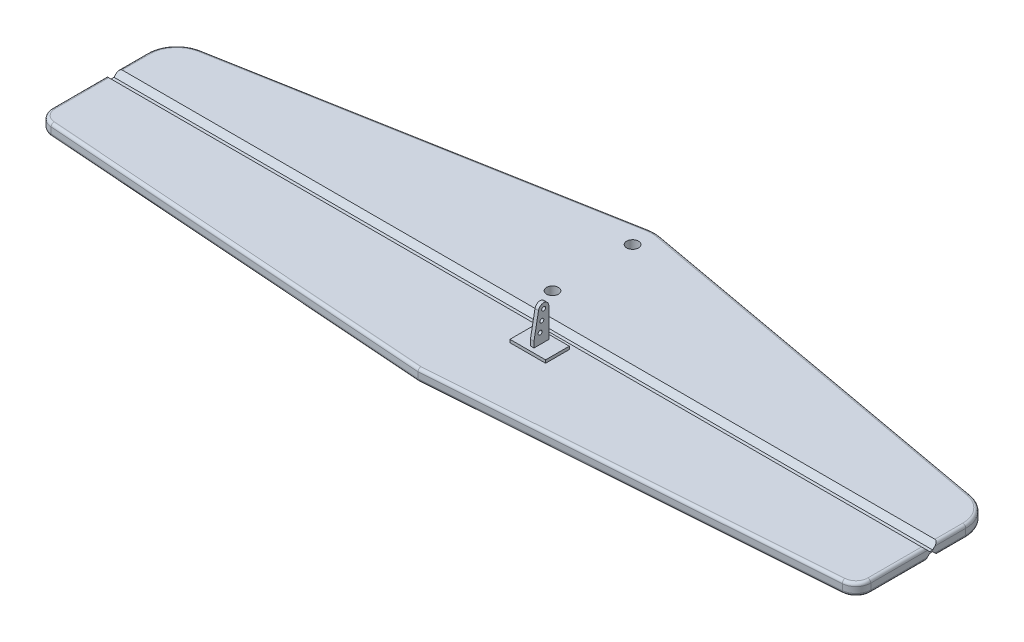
ISO-10303-21;
HEADER;
FILE_DESCRIPTION(('STEP AP214'),'2;1');
FILE_NAME('part.step','',(''),(''),'','','');
FILE_SCHEMA(('AUTOMOTIVE_DESIGN { 1 0 10303 214 1 1 1 1 }'));
ENDSEC;
DATA;
#1=APPLICATION_CONTEXT('core data for automotive mechanical design processes');
#2=APPLICATION_PROTOCOL_DEFINITION('international standard','automotive_design',2000,#1);
#3=PRODUCT_CONTEXT('',#1,'mechanical');
#4=PRODUCT('Part','Part','',(#3));
#5=PRODUCT_RELATED_PRODUCT_CATEGORY('part','',(#4));
#6=PRODUCT_DEFINITION_FORMATION('','',#4);
#7=PRODUCT_DEFINITION_CONTEXT('part definition',#1,'design');
#8=PRODUCT_DEFINITION('design','',#6,#7);
#9=PRODUCT_DEFINITION_SHAPE('','',#8);
#10=(LENGTH_UNIT() NAMED_UNIT(*) SI_UNIT(.MILLI.,.METRE.));
#11=(NAMED_UNIT(*) PLANE_ANGLE_UNIT() SI_UNIT($,.RADIAN.));
#12=(NAMED_UNIT(*) SI_UNIT($,.STERADIAN.) SOLID_ANGLE_UNIT());
#13=UNCERTAINTY_MEASURE_WITH_UNIT(LENGTH_MEASURE(1.E-05),#10,'distance_accuracy_value','');
#14=(GEOMETRIC_REPRESENTATION_CONTEXT(3) GLOBAL_UNCERTAINTY_ASSIGNED_CONTEXT((#13)) GLOBAL_UNIT_ASSIGNED_CONTEXT((#10,
#11,#12)) REPRESENTATION_CONTEXT('',''));
#15=CARTESIAN_POINT('',(0.,0.,0.));
#16=DIRECTION('',(0.,0.,1.));
#17=DIRECTION('',(1.,0.,0.));
#18=AXIS2_PLACEMENT_3D('',#15,#16,#17);
#19=CARTESIAN_POINT('',(8.,5.,12.));
#20=DIRECTION('',(0.,1.,0.));
#21=DIRECTION('',(0.,0.,1.));
#22=AXIS2_PLACEMENT_3D('',#19,#20,#21);
#23=PLANE('',#22);
#24=DIRECTION('',(0.,0.,1.));
#25=VECTOR('',#24,1.);
#26=CARTESIAN_POINT('',(8.,5.,4.));
#27=LINE('',#26,#25);
#28=CARTESIAN_POINT('',(8.,5.,4.));
#29=VERTEX_POINT('',#28);
#30=CARTESIAN_POINT('',(8.,5.,12.));
#31=VERTEX_POINT('',#30);
#32=EDGE_CURVE('E362',#29,#31,#27,.T.);
#33=ORIENTED_EDGE('',*,*,#32,.T.);
#34=DIRECTION('',(1.,0.,0.));
#35=VECTOR('',#34,1.);
#36=CARTESIAN_POINT('',(8.,5.,12.));
#37=LINE('',#36,#35);
#38=CARTESIAN_POINT('',(20.,5.,12.));
#39=VERTEX_POINT('',#38);
#40=EDGE_CURVE('E365',#31,#39,#37,.T.);
#41=ORIENTED_EDGE('',*,*,#40,.T.);
#42=DIRECTION('',(0.,0.,-1.));
#43=VECTOR('',#42,1.);
#44=CARTESIAN_POINT('',(20.,5.,4.));
#45=LINE('',#44,#43);
#46=CARTESIAN_POINT('',(20.,5.,4.));
#47=VERTEX_POINT('',#46);
#48=EDGE_CURVE('E368',#39,#47,#45,.T.);
#49=ORIENTED_EDGE('',*,*,#48,.T.);
#50=DIRECTION('',(-1.,0.,0.));
#51=VECTOR('',#50,1.);
#52=CARTESIAN_POINT('',(8.,5.,4.));
#53=LINE('',#52,#51);
#54=EDGE_CURVE('E370',#47,#29,#53,.T.);
#55=ORIENTED_EDGE('',*,*,#54,.T.);
#56=EDGE_LOOP('',(#33,#41,#49,#55));
#57=FACE_BOUND('',#56,.T.);
#58=DIRECTION('',(1.,0.,0.));
#59=VECTOR('',#58,1.);
#60=CARTESIAN_POINT('',(13.4,5.,10.5));
#61=LINE('',#60,#59);
#62=CARTESIAN_POINT('',(13.4,5.,10.5));
#63=VERTEX_POINT('',#62);
#64=CARTESIAN_POINT('',(14.6,5.,10.5));
#65=VERTEX_POINT('',#64);
#66=EDGE_CURVE('E347',#63,#65,#61,.T.);
#67=ORIENTED_EDGE('',*,*,#66,.F.);
#68=DIRECTION('',(0.,0.,1.));
#69=VECTOR('',#68,1.);
#70=CARTESIAN_POINT('',(13.4,5.,5.5));
#71=LINE('',#70,#69);
#72=CARTESIAN_POINT('',(13.4,5.,5.5));
#73=VERTEX_POINT('',#72);
#74=EDGE_CURVE('E342',#73,#63,#71,.T.);
#75=ORIENTED_EDGE('',*,*,#74,.F.);
#76=DIRECTION('',(-1.,0.,0.));
#77=VECTOR('',#76,1.);
#78=CARTESIAN_POINT('',(13.4,5.,5.5));
#79=LINE('',#78,#77);
#80=CARTESIAN_POINT('',(14.6,5.,5.5));
#81=VERTEX_POINT('',#80);
#82=EDGE_CURVE('E352',#81,#73,#79,.T.);
#83=ORIENTED_EDGE('',*,*,#82,.F.);
#84=DIRECTION('',(0.,0.,-1.));
#85=VECTOR('',#84,1.);
#86=CARTESIAN_POINT('',(14.6,5.,5.5));
#87=LINE('',#86,#85);
#88=EDGE_CURVE('E350',#65,#81,#87,.T.);
#89=ORIENTED_EDGE('',*,*,#88,.F.);
#90=EDGE_LOOP('',(#67,#75,#83,#89));
#91=FACE_BOUND('',#90,.T.);
#92=ADVANCED_FACE('F34',(#57,#91),#23,.T.);
#93=CARTESIAN_POINT('',(-133.,4.,20.3492085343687));
#94=DIRECTION('',(0.,-1.,0.));
#95=DIRECTION('',(0.,0.,-1.));
#96=AXIS2_PLACEMENT_3D('',#93,#94,#95);
#97=PLANE('',#96);
#98=CARTESIAN_POINT('',(133.,4.,20.3492085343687));
#99=DIRECTION('',(0.,-1.,0.));
#100=DIRECTION('',(0.,0.,-1.));
#101=AXIS2_PLACEMENT_3D('',#98,#99,#100);
#102=CIRCLE('',#101,4.);
#103=CARTESIAN_POINT('',(133.289097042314,4.,24.3387477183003));
#104=VERTEX_POINT('',#103);
#105=CARTESIAN_POINT('',(137.,4.,20.3492085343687));
#106=VERTEX_POINT('',#105);
#107=EDGE_CURVE('E579',#104,#106,#102,.F.);
#108=ORIENTED_EDGE('',*,*,#107,.T.);
#109=DIRECTION('',(0.,0.,-1.));
#110=VECTOR('',#109,1.);
#111=CARTESIAN_POINT('',(137.,4.,20.3492085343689));
#112=LINE('',#111,#110);
#113=CARTESIAN_POINT('',(137.,4.,2.2500000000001));
#114=VERTEX_POINT('',#113);
#115=EDGE_CURVE('E581',#106,#114,#112,.T.);
#116=ORIENTED_EDGE('',*,*,#115,.T.);
#117=DIRECTION('',(1.,0.,0.));
#118=VECTOR('',#117,1.);
#119=CARTESIAN_POINT('',(-138.,4.,2.24999999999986));
#120=LINE('',#119,#118);
#121=CARTESIAN_POINT('',(-137.,4.,2.24999999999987));
#122=VERTEX_POINT('',#121);
#123=EDGE_CURVE('E440',#122,#114,#120,.T.);
#124=ORIENTED_EDGE('',*,*,#123,.F.);
#125=DIRECTION('',(0.,0.,1.));
#126=VECTOR('',#125,1.);
#127=CARTESIAN_POINT('',(-137.,4.,20.3492085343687));
#128=LINE('',#127,#126);
#129=CARTESIAN_POINT('',(-137.,4.,20.3492085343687));
#130=VERTEX_POINT('',#129);
#131=EDGE_CURVE('E571',#122,#130,#128,.T.);
#132=ORIENTED_EDGE('',*,*,#131,.T.);
#133=CARTESIAN_POINT('',(-133.,4.,20.3492085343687));
#134=DIRECTION('',(0.,-1.,0.));
#135=DIRECTION('',(0.,0.,-1.));
#136=AXIS2_PLACEMENT_3D('',#133,#134,#135);
#137=CIRCLE('',#136,4.);
#138=CARTESIAN_POINT('',(-133.289097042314,4.,24.3387477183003));
#139=VERTEX_POINT('',#138);
#140=EDGE_CURVE('E573',#130,#139,#137,.F.);
#141=ORIENTED_EDGE('',*,*,#140,.T.);
#142=DIRECTION('',(0.997384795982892,0.,0.0722742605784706));
#143=VECTOR('',#142,1.);
#144=CARTESIAN_POINT('',(-133.289097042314,4.,24.3387477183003));
#145=LINE('',#144,#143);
#146=CARTESIAN_POINT('',(0.,4.,33.9973779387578));
#147=VERTEX_POINT('',#146);
#148=EDGE_CURVE('E575',#139,#147,#145,.T.);
#149=ORIENTED_EDGE('',*,*,#148,.T.);
#150=DIRECTION('',(0.997384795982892,0.,-0.0722742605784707));
#151=VECTOR('',#150,1.);
#152=CARTESIAN_POINT('',(-131.32143367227,4.,43.5134238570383));
#153=LINE('',#152,#151);
#154=EDGE_CURVE('E577',#147,#104,#153,.T.);
#155=ORIENTED_EDGE('',*,*,#154,.T.);
#156=EDGE_LOOP('',(#108,#116,#124,#132,#141,#149,#155));
#157=FACE_BOUND('',#156,.T.);
#158=DIRECTION('',(0.,0.,1.));
#159=VECTOR('',#158,1.);
#160=CARTESIAN_POINT('',(8.,4.,4.));
#161=LINE('',#160,#159);
#162=CARTESIAN_POINT('',(8.,4.,4.));
#163=VERTEX_POINT('',#162);
#164=CARTESIAN_POINT('',(8.00000000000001,4.,12.));
#165=VERTEX_POINT('',#164);
#166=EDGE_CURVE('E361',#163,#165,#161,.T.);
#167=ORIENTED_EDGE('',*,*,#166,.F.);
#168=DIRECTION('',(-1.,0.,0.));
#169=VECTOR('',#168,1.);
#170=CARTESIAN_POINT('',(8.,4.,4.));
#171=LINE('',#170,#169);
#172=CARTESIAN_POINT('',(20.,4.,4.));
#173=VERTEX_POINT('',#172);
#174=EDGE_CURVE('E366',#173,#163,#171,.T.);
#175=ORIENTED_EDGE('',*,*,#174,.F.);
#176=DIRECTION('',(0.,0.,-1.));
#177=VECTOR('',#176,1.);
#178=CARTESIAN_POINT('',(20.,4.,4.));
#179=LINE('',#178,#177);
#180=CARTESIAN_POINT('',(20.,4.,12.));
#181=VERTEX_POINT('',#180);
#182=EDGE_CURVE('E378',#181,#173,#179,.T.);
#183=ORIENTED_EDGE('',*,*,#182,.F.);
#184=DIRECTION('',(1.,0.,0.));
#185=VECTOR('',#184,1.);
#186=CARTESIAN_POINT('',(8.,4.,12.));
#187=LINE('',#186,#185);
#188=EDGE_CURVE('E375',#165,#181,#187,.T.);
#189=ORIENTED_EDGE('',*,*,#188,.F.);
#190=EDGE_LOOP('',(#167,#175,#183,#189));
#191=FACE_BOUND('',#190,.T.);
#192=ADVANCED_FACE('F801',(#157,#191),#97,.F.);
#193=CARTESIAN_POINT('',(-133.,0.,20.3492085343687));
#194=DIRECTION('',(0.,-1.,0.));
#195=DIRECTION('',(0.,0.,-1.));
#196=AXIS2_PLACEMENT_3D('',#193,#194,#195);
#197=PLANE('',#196);
#198=DIRECTION('',(1.,0.,0.));
#199=VECTOR('',#198,1.);
#200=CARTESIAN_POINT('',(-138.,0.,-2.2500000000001));
#201=LINE('',#200,#199);
#202=CARTESIAN_POINT('',(-137.,0.,-2.2500000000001));
#203=VERTEX_POINT('',#202);
#204=CARTESIAN_POINT('',(137.,0.,-2.24999999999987));
#205=VERTEX_POINT('',#204);
#206=EDGE_CURVE('E417',#203,#205,#201,.T.);
#207=ORIENTED_EDGE('',*,*,#206,.F.);
#208=DIRECTION('',(0.,0.,1.));
#209=VECTOR('',#208,1.);
#210=CARTESIAN_POINT('',(-137.,0.,-11.6488252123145));
#211=LINE('',#210,#209);
#212=CARTESIAN_POINT('',(-137.,0.,-11.6488252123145));
#213=VERTEX_POINT('',#212);
#214=EDGE_CURVE('E549',#203,#213,#211,.F.);
#215=ORIENTED_EDGE('',*,*,#214,.T.);
#216=CARTESIAN_POINT('',(-128.,0.,-11.6488252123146));
#217=DIRECTION('',(0.,-1.,0.));
#218=DIRECTION('',(0.,0.,-1.));
#219=AXIS2_PLACEMENT_3D('',#216,#217,#218);
#220=CIRCLE('',#219,9.);
#221=CARTESIAN_POINT('',(-129.604321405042,0.,-20.5046793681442));
#222=VERTEX_POINT('',#221);
#223=EDGE_CURVE('E547',#213,#222,#220,.T.);
#224=ORIENTED_EDGE('',*,*,#223,.T.);
#225=DIRECTION('',(-0.983983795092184,0.,0.178257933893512));
#226=VECTOR('',#225,1.);
#227=CARTESIAN_POINT('',(-1.60432140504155,0.,-43.6930851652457));
#228=LINE('',#227,#226);
#229=CARTESIAN_POINT('',(-1.60432140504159,0.,-43.6930851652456));
#230=VERTEX_POINT('',#229);
#231=EDGE_CURVE('E545',#222,#230,#228,.F.);
#232=ORIENTED_EDGE('',*,*,#231,.T.);
#233=CARTESIAN_POINT('',(0.,0.,-34.837231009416));
#234=DIRECTION('',(0.,-1.,0.));
#235=DIRECTION('',(0.,0.,-1.));
#236=AXIS2_PLACEMENT_3D('',#233,#234,#235);
#237=CIRCLE('',#236,9.);
#238=CARTESIAN_POINT('',(1.60432140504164,0.,-43.6930851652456));
#239=VERTEX_POINT('',#238);
#240=EDGE_CURVE('E543',#230,#239,#237,.T.);
#241=ORIENTED_EDGE('',*,*,#240,.T.);
#242=DIRECTION('',(-0.983983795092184,0.,-0.178257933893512));
#243=VECTOR('',#242,1.);
#244=CARTESIAN_POINT('',(129.604321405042,0.,-20.5046793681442));
#245=LINE('',#244,#243);
#246=CARTESIAN_POINT('',(129.604321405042,0.,-20.5046793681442));
#247=VERTEX_POINT('',#246);
#248=EDGE_CURVE('E541',#239,#247,#245,.F.);
#249=ORIENTED_EDGE('',*,*,#248,.T.);
#250=CARTESIAN_POINT('',(128.,0.,-11.6488252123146));
#251=DIRECTION('',(0.,-1.,0.));
#252=DIRECTION('',(0.,0.,-1.));
#253=AXIS2_PLACEMENT_3D('',#250,#251,#252);
#254=CIRCLE('',#253,9.);
#255=CARTESIAN_POINT('',(137.,0.,-11.6488252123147));
#256=VERTEX_POINT('',#255);
#257=EDGE_CURVE('E539',#247,#256,#254,.T.);
#258=ORIENTED_EDGE('',*,*,#257,.T.);
#259=DIRECTION('',(0.,0.,-1.));
#260=VECTOR('',#259,1.);
#261=CARTESIAN_POINT('',(137.,0.,-2.24999999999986));
#262=LINE('',#261,#260);
#263=EDGE_CURVE('E537',#256,#205,#262,.F.);
#264=ORIENTED_EDGE('',*,*,#263,.T.);
#265=EDGE_LOOP('',(#207,#215,#224,#232,#241,#249,#258,#264));
#266=FACE_BOUND('',#265,.T.);
#267=CARTESIAN_POINT('',(0.,0.,-10.337231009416));
#268=DIRECTION('',(0.,1.,0.));
#269=DIRECTION('',(0.,0.,1.));
#270=AXIS2_PLACEMENT_3D('',#267,#268,#269);
#271=CIRCLE('',#270,2.);
#272=CARTESIAN_POINT('',(0.,0.,-8.33723100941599));
#273=VERTEX_POINT('',#272);
#274=EDGE_CURVE('E443',#273,#273,#271,.T.);
#275=ORIENTED_EDGE('',*,*,#274,.T.);
#276=EDGE_LOOP('',(#275));
#277=FACE_BOUND('',#276,.T.);
#278=CARTESIAN_POINT('',(0.,0.,-37.337231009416));
#279=DIRECTION('',(0.,1.,0.));
#280=DIRECTION('',(0.,0.,1.));
#281=AXIS2_PLACEMENT_3D('',#278,#279,#280);
#282=CIRCLE('',#281,2.);
#283=CARTESIAN_POINT('',(0.,0.,-35.337231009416));
#284=VERTEX_POINT('',#283);
#285=EDGE_CURVE('E454',#284,#284,#282,.T.);
#286=ORIENTED_EDGE('',*,*,#285,.T.);
#287=EDGE_LOOP('',(#286));
#288=FACE_BOUND('',#287,.T.);
#289=ADVANCED_FACE('F798',(#266,#277,#288),#197,.T.);
#290=CARTESIAN_POINT('',(0.,4.,-37.337231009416));
#291=DIRECTION('',(0.,1.,0.));
#292=DIRECTION('',(0.,0.,1.));
#293=AXIS2_PLACEMENT_3D('',#290,#291,#292);
#294=CIRCLE('',#293,2.);
#295=CARTESIAN_POINT('',(0.,4.,-35.337231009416));
#296=VERTEX_POINT('',#295);
#297=EDGE_CURVE('E457',#296,#296,#294,.T.);
#298=ORIENTED_EDGE('',*,*,#297,.F.);
#299=EDGE_LOOP('',(#298));
#300=FACE_BOUND('',#299,.T.);
#301=CARTESIAN_POINT('',(-128.,4.,-11.6488252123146));
#302=DIRECTION('',(0.,-1.,0.));
#303=DIRECTION('',(0.,0.,-1.));
#304=AXIS2_PLACEMENT_3D('',#301,#302,#303);
#305=CIRCLE('',#304,9.);
#306=CARTESIAN_POINT('',(-129.604321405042,4.,-20.5046793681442));
#307=VERTEX_POINT('',#306);
#308=CARTESIAN_POINT('',(-137.,4.,-11.6488252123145));
#309=VERTEX_POINT('',#308);
#310=EDGE_CURVE('E610',#307,#309,#305,.F.);
#311=ORIENTED_EDGE('',*,*,#310,.T.);
#312=DIRECTION('',(0.,0.,1.));
#313=VECTOR('',#312,1.);
#314=CARTESIAN_POINT('',(-137.,4.,20.3492085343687));
#315=LINE('',#314,#313);
#316=CARTESIAN_POINT('',(-137.,4.,-2.2500000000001));
#317=VERTEX_POINT('',#316);
#318=EDGE_CURVE('E612',#309,#317,#315,.T.);
#319=ORIENTED_EDGE('',*,*,#318,.T.);
#320=DIRECTION('',(1.,0.,0.));
#321=VECTOR('',#320,1.);
#322=CARTESIAN_POINT('',(-138.,4.,-2.2500000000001));
#323=LINE('',#322,#321);
#324=CARTESIAN_POINT('',(137.,4.,-2.24999999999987));
#325=VERTEX_POINT('',#324);
#326=EDGE_CURVE('E444',#317,#325,#323,.T.);
#327=ORIENTED_EDGE('',*,*,#326,.T.);
#328=DIRECTION('',(0.,0.,-1.));
#329=VECTOR('',#328,1.);
#330=CARTESIAN_POINT('',(137.,4.,20.3492085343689));
#331=LINE('',#330,#329);
#332=CARTESIAN_POINT('',(137.,4.,-11.6488252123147));
#333=VERTEX_POINT('',#332);
#334=EDGE_CURVE('E600',#325,#333,#331,.T.);
#335=ORIENTED_EDGE('',*,*,#334,.T.);
#336=CARTESIAN_POINT('',(128.,4.,-11.6488252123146));
#337=DIRECTION('',(0.,-1.,0.));
#338=DIRECTION('',(0.,0.,-1.));
#339=AXIS2_PLACEMENT_3D('',#336,#337,#338);
#340=CIRCLE('',#339,9.);
#341=CARTESIAN_POINT('',(129.604321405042,4.,-20.5046793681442));
#342=VERTEX_POINT('',#341);
#343=EDGE_CURVE('E602',#333,#342,#340,.F.);
#344=ORIENTED_EDGE('',*,*,#343,.T.);
#345=DIRECTION('',(-0.983983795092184,0.,-0.178257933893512));
#346=VECTOR('',#345,1.);
#347=CARTESIAN_POINT('',(-117.489622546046,4.,-65.2680750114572));
#348=LINE('',#347,#346);
#349=CARTESIAN_POINT('',(1.60432140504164,4.,-43.6930851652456));
#350=VERTEX_POINT('',#349);
#351=EDGE_CURVE('E604',#342,#350,#348,.T.);
#352=ORIENTED_EDGE('',*,*,#351,.T.);
#353=CARTESIAN_POINT('',(0.,4.,-34.837231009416));
#354=DIRECTION('',(0.,-1.,0.));
#355=DIRECTION('',(0.,0.,-1.));
#356=AXIS2_PLACEMENT_3D('',#353,#354,#355);
#357=CIRCLE('',#356,9.);
#358=CARTESIAN_POINT('',(-1.60432140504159,4.,-43.6930851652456));
#359=VERTEX_POINT('',#358);
#360=EDGE_CURVE('E606',#350,#359,#357,.F.);
#361=ORIENTED_EDGE('',*,*,#360,.T.);
#362=DIRECTION('',(-0.983983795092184,0.,0.178257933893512));
#363=VECTOR('',#362,1.);
#364=CARTESIAN_POINT('',(-140.057990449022,4.,-18.6108987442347));
#365=LINE('',#364,#363);
#366=EDGE_CURVE('E608',#359,#307,#365,.T.);
#367=ORIENTED_EDGE('',*,*,#366,.T.);
#368=EDGE_LOOP('',(#311,#319,#327,#335,#344,#352,#361,#367));
#369=FACE_BOUND('',#368,.T.);
#370=CARTESIAN_POINT('',(0.,4.,-10.337231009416));
#371=DIRECTION('',(0.,1.,0.));
#372=DIRECTION('',(0.,0.,1.));
#373=AXIS2_PLACEMENT_3D('',#370,#371,#372);
#374=CIRCLE('',#373,2.);
#375=CARTESIAN_POINT('',(0.,4.,-8.33723100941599));
#376=VERTEX_POINT('',#375);
#377=EDGE_CURVE('E451',#376,#376,#374,.T.);
#378=ORIENTED_EDGE('',*,*,#377,.F.);
#379=EDGE_LOOP('',(#378));
#380=FACE_BOUND('',#379,.T.);
#381=ADVANCED_FACE('F794',(#300,#369,#380),#97,.F.);
#382=CARTESIAN_POINT('',(-133.,0.,20.3492085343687));
#383=DIRECTION('',(0.,-1.,0.));
#384=DIRECTION('',(0.,0.,-1.));
#385=AXIS2_PLACEMENT_3D('',#382,#383,#384);
#386=CIRCLE('',#385,4.);
#387=CARTESIAN_POINT('',(-133.289097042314,0.,24.3387477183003));
#388=VERTEX_POINT('',#387);
#389=CARTESIAN_POINT('',(-137.,0.,20.3492085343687));
#390=VERTEX_POINT('',#389);
#391=EDGE_CURVE('E513',#388,#390,#386,.T.);
#392=ORIENTED_EDGE('',*,*,#391,.T.);
#393=DIRECTION('',(0.,0.,1.));
#394=VECTOR('',#393,1.);
#395=CARTESIAN_POINT('',(-137.,0.,2.24999999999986));
#396=LINE('',#395,#394);
#397=CARTESIAN_POINT('',(-137.,0.,2.24999999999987));
#398=VERTEX_POINT('',#397);
#399=EDGE_CURVE('E515',#390,#398,#396,.F.);
#400=ORIENTED_EDGE('',*,*,#399,.T.);
#401=DIRECTION('',(1.,0.,0.));
#402=VECTOR('',#401,1.);
#403=CARTESIAN_POINT('',(-138.,0.,2.24999999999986));
#404=LINE('',#403,#402);
#405=CARTESIAN_POINT('',(137.,0.,2.2500000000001));
#406=VERTEX_POINT('',#405);
#407=EDGE_CURVE('E420',#398,#406,#404,.T.);
#408=ORIENTED_EDGE('',*,*,#407,.T.);
#409=DIRECTION('',(0.,0.,-1.));
#410=VECTOR('',#409,1.);
#411=CARTESIAN_POINT('',(137.,0.,20.3492085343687));
#412=LINE('',#411,#410);
#413=CARTESIAN_POINT('',(137.,0.,20.3492085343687));
#414=VERTEX_POINT('',#413);
#415=EDGE_CURVE('E505',#406,#414,#412,.F.);
#416=ORIENTED_EDGE('',*,*,#415,.T.);
#417=CARTESIAN_POINT('',(133.,0.,20.3492085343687));
#418=DIRECTION('',(0.,-1.,0.));
#419=DIRECTION('',(0.,0.,-1.));
#420=AXIS2_PLACEMENT_3D('',#417,#418,#419);
#421=CIRCLE('',#420,4.);
#422=CARTESIAN_POINT('',(133.289097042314,0.,24.3387477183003));
#423=VERTEX_POINT('',#422);
#424=EDGE_CURVE('E507',#414,#423,#421,.T.);
#425=ORIENTED_EDGE('',*,*,#424,.T.);
#426=DIRECTION('',(0.997384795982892,0.,-0.0722742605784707));
#427=VECTOR('',#426,1.);
#428=CARTESIAN_POINT('',(-0.0722742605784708,0.,34.0026152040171));
#429=LINE('',#428,#427);
#430=CARTESIAN_POINT('',(0.,0.,33.9973779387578));
#431=VERTEX_POINT('',#430);
#432=EDGE_CURVE('E509',#423,#431,#429,.F.);
#433=ORIENTED_EDGE('',*,*,#432,.T.);
#434=DIRECTION('',(0.997384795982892,0.,0.0722742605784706));
#435=VECTOR('',#434,1.);
#436=CARTESIAN_POINT('',(-133.289097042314,0.,24.3387477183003));
#437=LINE('',#436,#435);
#438=EDGE_CURVE('E511',#431,#388,#437,.F.);
#439=ORIENTED_EDGE('',*,*,#438,.T.);
#440=EDGE_LOOP('',(#392,#400,#408,#416,#425,#433,#439));
#441=FACE_BOUND('',#440,.T.);
#442=ADVANCED_FACE('F797',(#441),#197,.T.);
#443=CARTESIAN_POINT('',(0.,4.,35.));
#444=DIRECTION('',(0.0722742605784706,0.,-0.997384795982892));
#445=DIRECTION('',(-0.997384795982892,0.,-0.0722742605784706));
#446=AXIS2_PLACEMENT_3D('',#443,#444,#445);
#447=PLANE('',#446);
#448=DIRECTION('',(0.,-1.,0.));
#449=VECTOR('',#448,1.);
#450=CARTESIAN_POINT('',(0.,4.,35.));
#451=LINE('',#450,#449);
#452=CARTESIAN_POINT('',(0.,3.,35.));
#453=VERTEX_POINT('',#452);
#454=CARTESIAN_POINT('',(0.,1.,35.));
#455=VERTEX_POINT('',#454);
#456=EDGE_CURVE('E492',#453,#455,#451,.T.);
#457=ORIENTED_EDGE('',*,*,#456,.F.);
#458=DIRECTION('',(0.997384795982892,0.,0.0722742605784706));
#459=VECTOR('',#458,1.);
#460=CARTESIAN_POINT('',(0.,3.,35.));
#461=LINE('',#460,#459);
#462=CARTESIAN_POINT('',(-133.361371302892,3.,25.3361325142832));
#463=VERTEX_POINT('',#462);
#464=EDGE_CURVE('E598',#453,#463,#461,.F.);
#465=ORIENTED_EDGE('',*,*,#464,.T.);
#466=DIRECTION('',(0.,-1.,0.));
#467=VECTOR('',#466,1.);
#468=CARTESIAN_POINT('',(-133.361371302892,4.,25.3361325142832));
#469=LINE('',#468,#467);
#470=CARTESIAN_POINT('',(-133.361371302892,1.,25.3361325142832));
#471=VERTEX_POINT('',#470);
#472=EDGE_CURVE('E460',#463,#471,#469,.T.);
#473=ORIENTED_EDGE('',*,*,#472,.T.);
#474=DIRECTION('',(0.997384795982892,0.,0.0722742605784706));
#475=VECTOR('',#474,1.);
#476=CARTESIAN_POINT('',(0.,1.,35.));
#477=LINE('',#476,#475);
#478=EDGE_CURVE('E596',#471,#455,#477,.T.);
#479=ORIENTED_EDGE('',*,*,#478,.T.);
#480=EDGE_LOOP('',(#457,#465,#473,#479));
#481=FACE_BOUND('',#480,.T.);
#482=ADVANCED_FACE('F734',(#481),#447,.F.);
#483=CARTESIAN_POINT('',(0.,4.,35.));
#484=DIRECTION('',(-0.0722742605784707,0.,-0.997384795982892));
#485=DIRECTION('',(-0.997384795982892,0.,0.0722742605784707));
#486=AXIS2_PLACEMENT_3D('',#483,#484,#485);
#487=PLANE('',#486);
#488=ORIENTED_EDGE('',*,*,#456,.T.);
#489=DIRECTION('',(0.997384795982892,0.,-0.0722742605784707));
#490=VECTOR('',#489,1.);
#491=CARTESIAN_POINT('',(133.361371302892,1.,25.3361325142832));
#492=LINE('',#491,#490);
#493=CARTESIAN_POINT('',(133.361371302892,1.,25.3361325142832));
#494=VERTEX_POINT('',#493);
#495=EDGE_CURVE('E527',#455,#494,#492,.T.);
#496=ORIENTED_EDGE('',*,*,#495,.T.);
#497=DIRECTION('',(0.,-1.,0.));
#498=VECTOR('',#497,1.);
#499=CARTESIAN_POINT('',(133.361371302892,4.,25.3361325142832));
#500=LINE('',#499,#498);
#501=CARTESIAN_POINT('',(133.361371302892,3.,25.3361325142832));
#502=VERTEX_POINT('',#501);
#503=EDGE_CURVE('E489',#502,#494,#500,.T.);
#504=ORIENTED_EDGE('',*,*,#503,.F.);
#505=DIRECTION('',(0.997384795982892,0.,-0.0722742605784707));
#506=VECTOR('',#505,1.);
#507=CARTESIAN_POINT('',(0.,3.,35.));
#508=LINE('',#507,#506);
#509=EDGE_CURVE('E525',#502,#453,#508,.F.);
#510=ORIENTED_EDGE('',*,*,#509,.T.);
#511=EDGE_LOOP('',(#488,#496,#504,#510));
#512=FACE_BOUND('',#511,.T.);
#513=ADVANCED_FACE('F720',(#512),#487,.F.);
#514=CARTESIAN_POINT('',(133.,4.,20.3492085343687));
#515=DIRECTION('',(0.,-1.,0.));
#516=DIRECTION('',(0.,0.,-1.));
#517=AXIS2_PLACEMENT_3D('',#514,#515,#516);
#518=CYLINDRICAL_SURFACE('',#517,5.);
#519=ORIENTED_EDGE('',*,*,#503,.T.);
#520=CARTESIAN_POINT('',(133.,1.,20.3492085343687));
#521=DIRECTION('',(0.,-1.,0.));
#522=DIRECTION('',(0.,0.,-1.));
#523=AXIS2_PLACEMENT_3D('',#520,#521,#522);
#524=CIRCLE('',#523,5.);
#525=CARTESIAN_POINT('',(138.,1.,20.3492085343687));
#526=VERTEX_POINT('',#525);
#527=EDGE_CURVE('E531',#494,#526,#524,.F.);
#528=ORIENTED_EDGE('',*,*,#527,.T.);
#529=DIRECTION('',(0.,-1.,0.));
#530=VECTOR('',#529,1.);
#531=CARTESIAN_POINT('',(138.,4.,20.3492085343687));
#532=LINE('',#531,#530);
#533=CARTESIAN_POINT('',(138.,3.,20.3492085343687));
#534=VERTEX_POINT('',#533);
#535=EDGE_CURVE('E486',#534,#526,#532,.T.);
#536=ORIENTED_EDGE('',*,*,#535,.F.);
#537=CARTESIAN_POINT('',(133.,3.,20.3492085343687));
#538=DIRECTION('',(0.,-1.,0.));
#539=DIRECTION('',(0.,0.,-1.));
#540=AXIS2_PLACEMENT_3D('',#537,#538,#539);
#541=CIRCLE('',#540,5.);
#542=EDGE_CURVE('E529',#534,#502,#541,.T.);
#543=ORIENTED_EDGE('',*,*,#542,.T.);
#544=EDGE_LOOP('',(#519,#528,#536,#543));
#545=FACE_BOUND('',#544,.T.);
#546=ADVANCED_FACE('F716',(#545),#518,.T.);
#547=CARTESIAN_POINT('',(138.,4.,20.3492085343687));
#548=DIRECTION('',(-1.,0.,0.));
#549=DIRECTION('',(0.,0.,1.));
#550=AXIS2_PLACEMENT_3D('',#547,#548,#549);
#551=PLANE('',#550);
#552=DIRECTION('',(0.,-0.70710678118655,-0.707106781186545));
#553=VECTOR('',#552,1.);
#554=CARTESIAN_POINT('',(138.,2.25,0.500000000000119));
#555=LINE('',#554,#553);
#556=CARTESIAN_POINT('',(138.,3.,1.25000000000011));
#557=VERTEX_POINT('',#556);
#558=CARTESIAN_POINT('',(138.,2.25,0.500000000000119));
#559=VERTEX_POINT('',#558);
#560=EDGE_CURVE('E416',#557,#559,#555,.T.);
#561=ORIENTED_EDGE('',*,*,#560,.F.);
#562=DIRECTION('',(0.,0.,-1.));
#563=VECTOR('',#562,1.);
#564=CARTESIAN_POINT('',(138.,3.,20.3492085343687));
#565=LINE('',#564,#563);
#566=EDGE_CURVE('E594',#557,#534,#565,.F.);
#567=ORIENTED_EDGE('',*,*,#566,.T.);
#568=ORIENTED_EDGE('',*,*,#535,.T.);
#569=DIRECTION('',(0.,0.,-1.));
#570=VECTOR('',#569,1.);
#571=CARTESIAN_POINT('',(138.,1.,2.25000000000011));
#572=LINE('',#571,#570);
#573=CARTESIAN_POINT('',(138.,1.,1.25000000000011));
#574=VERTEX_POINT('',#573);
#575=EDGE_CURVE('E592',#526,#574,#572,.T.);
#576=ORIENTED_EDGE('',*,*,#575,.T.);
#577=DIRECTION('',(0.,-0.70710678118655,0.707106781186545));
#578=VECTOR('',#577,1.);
#579=CARTESIAN_POINT('',(138.,1.75,0.500000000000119));
#580=LINE('',#579,#578);
#581=CARTESIAN_POINT('',(138.,1.75,0.500000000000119));
#582=VERTEX_POINT('',#581);
#583=EDGE_CURVE('E408',#582,#574,#580,.T.);
#584=ORIENTED_EDGE('',*,*,#583,.F.);
#585=DIRECTION('',(0.,0.,1.));
#586=VECTOR('',#585,1.);
#587=CARTESIAN_POINT('',(138.,1.75,-0.49999999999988));
#588=LINE('',#587,#586);
#589=CARTESIAN_POINT('',(138.,1.75,-0.49999999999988));
#590=VERTEX_POINT('',#589);
#591=EDGE_CURVE('E405',#590,#582,#588,.T.);
#592=ORIENTED_EDGE('',*,*,#591,.F.);
#593=DIRECTION('',(0.,0.70710678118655,0.707106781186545));
#594=VECTOR('',#593,1.);
#595=CARTESIAN_POINT('',(138.,1.75,-0.49999999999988));
#596=LINE('',#595,#594);
#597=CARTESIAN_POINT('',(138.,1.,-1.24999999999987));
#598=VERTEX_POINT('',#597);
#599=EDGE_CURVE('E399',#598,#590,#596,.T.);
#600=ORIENTED_EDGE('',*,*,#599,.F.);
#601=DIRECTION('',(0.,0.,-1.));
#602=VECTOR('',#601,1.);
#603=CARTESIAN_POINT('',(138.,1.,-11.6488252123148));
#604=LINE('',#603,#602);
#605=CARTESIAN_POINT('',(138.,1.,-11.6488252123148));
#606=VERTEX_POINT('',#605);
#607=EDGE_CURVE('E590',#598,#606,#604,.T.);
#608=ORIENTED_EDGE('',*,*,#607,.T.);
#609=DIRECTION('',(0.,-1.,0.));
#610=VECTOR('',#609,1.);
#611=CARTESIAN_POINT('',(138.,4.,-11.6488252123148));
#612=LINE('',#611,#610);
#613=CARTESIAN_POINT('',(138.,3.,-11.6488252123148));
#614=VERTEX_POINT('',#613);
#615=EDGE_CURVE('E483',#614,#606,#612,.T.);
#616=ORIENTED_EDGE('',*,*,#615,.F.);
#617=DIRECTION('',(0.,0.,-1.));
#618=VECTOR('',#617,1.);
#619=CARTESIAN_POINT('',(138.,3.,20.3492085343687));
#620=LINE('',#619,#618);
#621=CARTESIAN_POINT('',(138.,3.,-1.24999999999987));
#622=VERTEX_POINT('',#621);
#623=EDGE_CURVE('E588',#614,#622,#620,.F.);
#624=ORIENTED_EDGE('',*,*,#623,.T.);
#625=DIRECTION('',(0.,0.70710678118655,-0.707106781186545));
#626=VECTOR('',#625,1.);
#627=CARTESIAN_POINT('',(138.,2.25,-0.49999999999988));
#628=LINE('',#627,#626);
#629=CARTESIAN_POINT('',(138.,2.25,-0.49999999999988));
#630=VERTEX_POINT('',#629);
#631=EDGE_CURVE('E427',#630,#622,#628,.T.);
#632=ORIENTED_EDGE('',*,*,#631,.F.);
#633=DIRECTION('',(0.,0.,-1.));
#634=VECTOR('',#633,1.);
#635=CARTESIAN_POINT('',(138.,2.25,-0.49999999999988));
#636=LINE('',#635,#634);
#637=EDGE_CURVE('E435',#559,#630,#636,.T.);
#638=ORIENTED_EDGE('',*,*,#637,.F.);
#639=EDGE_LOOP('',(#561,#567,#568,#576,#584,#592,#600,#608,#616,#624,#632,#638));
#640=FACE_BOUND('',#639,.T.);
#641=ADVANCED_FACE('F692',(#640),#551,.F.);
#642=CARTESIAN_POINT('',(128.,4.,-11.6488252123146));
#643=DIRECTION('',(0.,-1.,0.));
#644=DIRECTION('',(0.,0.,-1.));
#645=AXIS2_PLACEMENT_3D('',#642,#643,#644);
#646=CYLINDRICAL_SURFACE('',#645,10.);
#647=ORIENTED_EDGE('',*,*,#615,.T.);
#648=CARTESIAN_POINT('',(128.,1.,-11.6488252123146));
#649=DIRECTION('',(0.,-1.,0.));
#650=DIRECTION('',(0.,0.,-1.));
#651=AXIS2_PLACEMENT_3D('',#648,#649,#650);
#652=CIRCLE('',#651,10.);
#653=CARTESIAN_POINT('',(129.782579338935,1.,-21.4886631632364));
#654=VERTEX_POINT('',#653);
#655=EDGE_CURVE('E569',#606,#654,#652,.F.);
#656=ORIENTED_EDGE('',*,*,#655,.T.);
#657=DIRECTION('',(0.,-1.,0.));
#658=VECTOR('',#657,1.);
#659=CARTESIAN_POINT('',(129.782579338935,4.,-21.4886631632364));
#660=LINE('',#659,#658);
#661=CARTESIAN_POINT('',(129.782579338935,3.,-21.4886631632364));
#662=VERTEX_POINT('',#661);
#663=EDGE_CURVE('E480',#662,#654,#660,.T.);
#664=ORIENTED_EDGE('',*,*,#663,.F.);
#665=CARTESIAN_POINT('',(128.,3.,-11.6488252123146));
#666=DIRECTION('',(0.,-1.,0.));
#667=DIRECTION('',(0.,0.,-1.));
#668=AXIS2_PLACEMENT_3D('',#665,#666,#667);
#669=CIRCLE('',#668,10.);
#670=EDGE_CURVE('E567',#662,#614,#669,.T.);
#671=ORIENTED_EDGE('',*,*,#670,.T.);
#672=EDGE_LOOP('',(#647,#656,#664,#671));
#673=FACE_BOUND('',#672,.T.);
#674=ADVANCED_FACE('F1387',(#673),#646,.T.);
#675=CARTESIAN_POINT('',(129.782579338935,4.,-21.4886631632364));
#676=DIRECTION('',(-0.178257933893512,0.,0.983983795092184));
#677=DIRECTION('',(0.983983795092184,0.,0.178257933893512));
#678=AXIS2_PLACEMENT_3D('',#675,#676,#677);
#679=PLANE('',#678);
#680=ORIENTED_EDGE('',*,*,#663,.T.);
#681=DIRECTION('',(-0.983983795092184,0.,-0.178257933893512));
#682=VECTOR('',#681,1.);
#683=CARTESIAN_POINT('',(1.78257933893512,1.,-44.6770689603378));
#684=LINE('',#683,#682);
#685=CARTESIAN_POINT('',(1.78257933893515,1.,-44.6770689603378));
#686=VERTEX_POINT('',#685);
#687=EDGE_CURVE('E565',#654,#686,#684,.T.);
#688=ORIENTED_EDGE('',*,*,#687,.T.);
#689=DIRECTION('',(0.,-1.,0.));
#690=VECTOR('',#689,1.);
#691=CARTESIAN_POINT('',(1.78257933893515,4.,-44.6770689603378));
#692=LINE('',#691,#690);
#693=CARTESIAN_POINT('',(1.78257933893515,3.,-44.6770689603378));
#694=VERTEX_POINT('',#693);
#695=EDGE_CURVE('E477',#694,#686,#692,.T.);
#696=ORIENTED_EDGE('',*,*,#695,.F.);
#697=DIRECTION('',(-0.983983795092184,0.,-0.178257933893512));
#698=VECTOR('',#697,1.);
#699=CARTESIAN_POINT('',(129.782579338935,3.,-21.4886631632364));
#700=LINE('',#699,#698);
#701=EDGE_CURVE('E563',#694,#662,#700,.F.);
#702=ORIENTED_EDGE('',*,*,#701,.T.);
#703=EDGE_LOOP('',(#680,#688,#696,#702));
#704=FACE_BOUND('',#703,.T.);
#705=ADVANCED_FACE('F789',(#704),#679,.F.);
#706=CARTESIAN_POINT('',(0.,4.,-34.837231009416));
#707=DIRECTION('',(0.,-1.,0.));
#708=DIRECTION('',(0.,0.,-1.));
#709=AXIS2_PLACEMENT_3D('',#706,#707,#708);
#710=CYLINDRICAL_SURFACE('',#709,10.);
#711=ORIENTED_EDGE('',*,*,#695,.T.);
#712=CARTESIAN_POINT('',(0.,1.,-34.837231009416));
#713=DIRECTION('',(0.,-1.,0.));
#714=DIRECTION('',(0.,0.,-1.));
#715=AXIS2_PLACEMENT_3D('',#712,#713,#714);
#716=CIRCLE('',#715,10.);
#717=CARTESIAN_POINT('',(-1.7825793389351,1.,-44.6770689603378));
#718=VERTEX_POINT('',#717);
#719=EDGE_CURVE('E561',#686,#718,#716,.F.);
#720=ORIENTED_EDGE('',*,*,#719,.T.);
#721=DIRECTION('',(0.,-1.,0.));
#722=VECTOR('',#721,1.);
#723=CARTESIAN_POINT('',(-1.7825793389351,4.,-44.6770689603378));
#724=LINE('',#723,#722);
#725=CARTESIAN_POINT('',(-1.7825793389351,3.,-44.6770689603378));
#726=VERTEX_POINT('',#725);
#727=EDGE_CURVE('E474',#726,#718,#724,.T.);
#728=ORIENTED_EDGE('',*,*,#727,.F.);
#729=CARTESIAN_POINT('',(0.,3.,-34.837231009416));
#730=DIRECTION('',(0.,-1.,0.));
#731=DIRECTION('',(0.,0.,-1.));
#732=AXIS2_PLACEMENT_3D('',#729,#730,#731);
#733=CIRCLE('',#732,10.);
#734=EDGE_CURVE('E559',#726,#694,#733,.T.);
#735=ORIENTED_EDGE('',*,*,#734,.T.);
#736=EDGE_LOOP('',(#711,#720,#728,#735));
#737=FACE_BOUND('',#736,.T.);
#738=ADVANCED_FACE('F786',(#737),#710,.T.);
#739=CARTESIAN_POINT('',(-129.782579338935,4.,-21.4886631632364));
#740=DIRECTION('',(0.178257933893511,0.,0.983983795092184));
#741=DIRECTION('',(0.983983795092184,0.,-0.178257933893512));
#742=AXIS2_PLACEMENT_3D('',#739,#740,#741);
#743=PLANE('',#742);
#744=ORIENTED_EDGE('',*,*,#727,.T.);
#745=DIRECTION('',(-0.983983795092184,0.,0.178257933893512));
#746=VECTOR('',#745,1.);
#747=CARTESIAN_POINT('',(-129.782579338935,1.,-21.4886631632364));
#748=LINE('',#747,#746);
#749=CARTESIAN_POINT('',(-129.782579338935,1.,-21.4886631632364));
#750=VERTEX_POINT('',#749);
#751=EDGE_CURVE('E557',#718,#750,#748,.T.);
#752=ORIENTED_EDGE('',*,*,#751,.T.);
#753=DIRECTION('',(0.,-1.,0.));
#754=VECTOR('',#753,1.);
#755=CARTESIAN_POINT('',(-129.782579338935,4.,-21.4886631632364));
#756=LINE('',#755,#754);
#757=CARTESIAN_POINT('',(-129.782579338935,3.,-21.4886631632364));
#758=VERTEX_POINT('',#757);
#759=EDGE_CURVE('E471',#758,#750,#756,.T.);
#760=ORIENTED_EDGE('',*,*,#759,.F.);
#761=DIRECTION('',(-0.983983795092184,0.,0.178257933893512));
#762=VECTOR('',#761,1.);
#763=CARTESIAN_POINT('',(-129.782579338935,3.,-21.4886631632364));
#764=LINE('',#763,#762);
#765=EDGE_CURVE('E555',#758,#726,#764,.F.);
#766=ORIENTED_EDGE('',*,*,#765,.T.);
#767=EDGE_LOOP('',(#744,#752,#760,#766));
#768=FACE_BOUND('',#767,.T.);
#769=ADVANCED_FACE('F772',(#768),#743,.F.);
#770=CARTESIAN_POINT('',(-128.,4.,-11.6488252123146));
#771=DIRECTION('',(0.,-1.,0.));
#772=DIRECTION('',(0.,0.,-1.));
#773=AXIS2_PLACEMENT_3D('',#770,#771,#772);
#774=CYLINDRICAL_SURFACE('',#773,10.);
#775=ORIENTED_EDGE('',*,*,#759,.T.);
#776=CARTESIAN_POINT('',(-128.,1.,-11.6488252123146));
#777=DIRECTION('',(0.,-1.,0.));
#778=DIRECTION('',(0.,0.,-1.));
#779=AXIS2_PLACEMENT_3D('',#776,#777,#778);
#780=CIRCLE('',#779,10.);
#781=CARTESIAN_POINT('',(-138.,1.,-11.6488252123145));
#782=VERTEX_POINT('',#781);
#783=EDGE_CURVE('E553',#750,#782,#780,.F.);
#784=ORIENTED_EDGE('',*,*,#783,.T.);
#785=DIRECTION('',(0.,-1.,0.));
#786=VECTOR('',#785,1.);
#787=CARTESIAN_POINT('',(-138.,4.,-11.6488252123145));
#788=LINE('',#787,#786);
#789=CARTESIAN_POINT('',(-138.,3.,-11.6488252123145));
#790=VERTEX_POINT('',#789);
#791=EDGE_CURVE('E468',#790,#782,#788,.T.);
#792=ORIENTED_EDGE('',*,*,#791,.F.);
#793=CARTESIAN_POINT('',(-128.,3.,-11.6488252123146));
#794=DIRECTION('',(0.,-1.,0.));
#795=DIRECTION('',(0.,0.,-1.));
#796=AXIS2_PLACEMENT_3D('',#793,#794,#795);
#797=CIRCLE('',#796,10.);
#798=EDGE_CURVE('E551',#790,#758,#797,.T.);
#799=ORIENTED_EDGE('',*,*,#798,.T.);
#800=EDGE_LOOP('',(#775,#784,#792,#799));
#801=FACE_BOUND('',#800,.T.);
#802=ADVANCED_FACE('F768',(#801),#774,.T.);
#803=CARTESIAN_POINT('',(-138.,4.,20.3492085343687));
#804=DIRECTION('',(1.,0.,0.));
#805=DIRECTION('',(0.,0.,-1.));
#806=AXIS2_PLACEMENT_3D('',#803,#804,#805);
#807=PLANE('',#806);
#808=DIRECTION('',(0.,-0.70710678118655,0.707106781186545));
#809=VECTOR('',#808,1.);
#810=CARTESIAN_POINT('',(-138.,1.75,0.49999999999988));
#811=LINE('',#810,#809);
#812=CARTESIAN_POINT('',(-138.,1.75,0.49999999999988));
#813=VERTEX_POINT('',#812);
#814=CARTESIAN_POINT('',(-138.,1.,1.24999999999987));
#815=VERTEX_POINT('',#814);
#816=EDGE_CURVE('E398',#813,#815,#811,.T.);
#817=ORIENTED_EDGE('',*,*,#816,.T.);
#818=DIRECTION('',(0.,0.,1.));
#819=VECTOR('',#818,1.);
#820=CARTESIAN_POINT('',(-138.,1.,20.3492085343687));
#821=LINE('',#820,#819);
#822=CARTESIAN_POINT('',(-138.,1.,20.3492085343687));
#823=VERTEX_POINT('',#822);
#824=EDGE_CURVE('E502',#815,#823,#821,.T.);
#825=ORIENTED_EDGE('',*,*,#824,.T.);
#826=DIRECTION('',(0.,-1.,0.));
#827=VECTOR('',#826,1.);
#828=CARTESIAN_POINT('',(-138.,4.,20.3492085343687));
#829=LINE('',#828,#827);
#830=CARTESIAN_POINT('',(-138.,3.,20.3492085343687));
#831=VERTEX_POINT('',#830);
#832=EDGE_CURVE('E465',#831,#823,#829,.T.);
#833=ORIENTED_EDGE('',*,*,#832,.F.);
#834=DIRECTION('',(0.,0.,1.));
#835=VECTOR('',#834,1.);
#836=CARTESIAN_POINT('',(-138.,3.,20.3492085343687));
#837=LINE('',#836,#835);
#838=CARTESIAN_POINT('',(-138.,3.,1.24999999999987));
#839=VERTEX_POINT('',#838);
#840=EDGE_CURVE('E495',#831,#839,#837,.F.);
#841=ORIENTED_EDGE('',*,*,#840,.T.);
#842=DIRECTION('',(0.,-0.70710678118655,-0.707106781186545));
#843=VECTOR('',#842,1.);
#844=CARTESIAN_POINT('',(-138.,2.25,0.49999999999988));
#845=LINE('',#844,#843);
#846=CARTESIAN_POINT('',(-138.,2.25,0.49999999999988));
#847=VERTEX_POINT('',#846);
#848=EDGE_CURVE('E424',#839,#847,#845,.T.);
#849=ORIENTED_EDGE('',*,*,#848,.T.);
#850=DIRECTION('',(0.,0.,-1.));
#851=VECTOR('',#850,1.);
#852=CARTESIAN_POINT('',(-138.,2.25,-0.500000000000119));
#853=LINE('',#852,#851);
#854=CARTESIAN_POINT('',(-138.,2.25,-0.500000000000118));
#855=VERTEX_POINT('',#854);
#856=EDGE_CURVE('E426',#847,#855,#853,.T.);
#857=ORIENTED_EDGE('',*,*,#856,.T.);
#858=DIRECTION('',(0.,0.70710678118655,-0.707106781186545));
#859=VECTOR('',#858,1.);
#860=CARTESIAN_POINT('',(-138.,2.25,-0.500000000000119));
#861=LINE('',#860,#859);
#862=CARTESIAN_POINT('',(-138.,3.,-1.25000000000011));
#863=VERTEX_POINT('',#862);
#864=EDGE_CURVE('E430',#855,#863,#861,.T.);
#865=ORIENTED_EDGE('',*,*,#864,.T.);
#866=DIRECTION('',(0.,0.,1.));
#867=VECTOR('',#866,1.);
#868=CARTESIAN_POINT('',(-138.,3.,20.3492085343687));
#869=LINE('',#868,#867);
#870=EDGE_CURVE('E497',#863,#790,#869,.F.);
#871=ORIENTED_EDGE('',*,*,#870,.T.);
#872=ORIENTED_EDGE('',*,*,#791,.T.);
#873=DIRECTION('',(0.,0.,1.));
#874=VECTOR('',#873,1.);
#875=CARTESIAN_POINT('',(-138.,1.,-2.2500000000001));
#876=LINE('',#875,#874);
#877=CARTESIAN_POINT('',(-138.,1.,-1.25000000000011));
#878=VERTEX_POINT('',#877);
#879=EDGE_CURVE('E499',#782,#878,#876,.T.);
#880=ORIENTED_EDGE('',*,*,#879,.T.);
#881=DIRECTION('',(0.,0.70710678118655,0.707106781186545));
#882=VECTOR('',#881,1.);
#883=CARTESIAN_POINT('',(-138.,1.75,-0.500000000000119));
#884=LINE('',#883,#882);
#885=CARTESIAN_POINT('',(-138.,1.75,-0.500000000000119));
#886=VERTEX_POINT('',#885);
#887=EDGE_CURVE('E402',#878,#886,#884,.T.);
#888=ORIENTED_EDGE('',*,*,#887,.T.);
#889=DIRECTION('',(0.,0.,1.));
#890=VECTOR('',#889,1.);
#891=CARTESIAN_POINT('',(-138.,1.75,-0.500000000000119));
#892=LINE('',#891,#890);
#893=EDGE_CURVE('E395',#886,#813,#892,.T.);
#894=ORIENTED_EDGE('',*,*,#893,.T.);
#895=EDGE_LOOP('',(#817,#825,#833,#841,#849,#857,#865,#871,#872,#880,#888,#894));
#896=FACE_BOUND('',#895,.T.);
#897=ADVANCED_FACE('F752',(#896),#807,.F.);
#898=CARTESIAN_POINT('',(-133.,4.,20.3492085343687));
#899=DIRECTION('',(0.,-1.,0.));
#900=DIRECTION('',(0.,0.,-1.));
#901=AXIS2_PLACEMENT_3D('',#898,#899,#900);
#902=CYLINDRICAL_SURFACE('',#901,5.);
#903=ORIENTED_EDGE('',*,*,#832,.T.);
#904=CARTESIAN_POINT('',(-133.,1.,20.3492085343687));
#905=DIRECTION('',(0.,-1.,0.));
#906=DIRECTION('',(0.,0.,-1.));
#907=AXIS2_PLACEMENT_3D('',#904,#905,#906);
#908=CIRCLE('',#907,5.);
#909=EDGE_CURVE('E523',#823,#471,#908,.F.);
#910=ORIENTED_EDGE('',*,*,#909,.T.);
#911=ORIENTED_EDGE('',*,*,#472,.F.);
#912=CARTESIAN_POINT('',(-133.,3.,20.3492085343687));
#913=DIRECTION('',(0.,-1.,0.));
#914=DIRECTION('',(0.,0.,-1.));
#915=AXIS2_PLACEMENT_3D('',#912,#913,#914);
#916=CIRCLE('',#915,5.);
#917=EDGE_CURVE('E521',#463,#831,#916,.T.);
#918=ORIENTED_EDGE('',*,*,#917,.T.);
#919=EDGE_LOOP('',(#903,#910,#911,#918));
#920=FACE_BOUND('',#919,.T.);
#921=ADVANCED_FACE('F738',(#920),#902,.T.);
#922=CARTESIAN_POINT('',(0.,4.,-37.337231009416));
#923=DIRECTION('',(0.,-1.,0.));
#924=DIRECTION('',(0.,0.,-1.));
#925=AXIS2_PLACEMENT_3D('',#922,#923,#924);
#926=CYLINDRICAL_SURFACE('',#925,2.);
#927=ORIENTED_EDGE('',*,*,#297,.T.);
#928=EDGE_LOOP('',(#927));
#929=FACE_BOUND('',#928,.T.);
#930=ORIENTED_EDGE('',*,*,#285,.F.);
#931=EDGE_LOOP('',(#930));
#932=FACE_BOUND('',#931,.T.);
#933=ADVANCED_FACE('F807',(#929,#932),#926,.F.);
#934=CARTESIAN_POINT('',(0.,4.,-10.337231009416));
#935=DIRECTION('',(0.,-1.,0.));
#936=DIRECTION('',(0.,0.,-1.));
#937=AXIS2_PLACEMENT_3D('',#934,#935,#936);
#938=CYLINDRICAL_SURFACE('',#937,2.);
#939=ORIENTED_EDGE('',*,*,#377,.T.);
#940=EDGE_LOOP('',(#939));
#941=FACE_BOUND('',#940,.T.);
#942=ORIENTED_EDGE('',*,*,#274,.F.);
#943=EDGE_LOOP('',(#942));
#944=FACE_BOUND('',#943,.T.);
#945=ADVANCED_FACE('F804',(#941,#944),#938,.F.);
#946=CARTESIAN_POINT('',(-138.,2.25,0.49999999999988));
#947=DIRECTION('',(0.,-0.707106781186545,0.70710678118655));
#948=DIRECTION('',(0.,-0.70710678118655,-0.707106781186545));
#949=AXIS2_PLACEMENT_3D('',#946,#947,#948);
#950=PLANE('',#949);
#951=ORIENTED_EDGE('',*,*,#123,.T.);
#952=CARTESIAN_POINT('',(137.,3.,1.25000000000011));
#953=DIRECTION('',(0.,-0.707106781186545,0.70710678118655));
#954=DIRECTION('',(0.,-0.70710678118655,-0.707106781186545));
#955=AXIS2_PLACEMENT_3D('',#952,#953,#954);
#956=ELLIPSE('',#955,1.41421356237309,1.);
#957=EDGE_CURVE('E586',#114,#557,#956,.F.);
#958=ORIENTED_EDGE('',*,*,#957,.T.);
#959=ORIENTED_EDGE('',*,*,#560,.T.);
#960=DIRECTION('',(1.,0.,0.));
#961=VECTOR('',#960,1.);
#962=CARTESIAN_POINT('',(-138.,2.25,0.49999999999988));
#963=LINE('',#962,#961);
#964=EDGE_CURVE('E433',#847,#559,#963,.T.);
#965=ORIENTED_EDGE('',*,*,#964,.F.);
#966=ORIENTED_EDGE('',*,*,#848,.F.);
#967=CARTESIAN_POINT('',(-137.,3.,1.24999999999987));
#968=DIRECTION('',(0.,-0.707106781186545,0.70710678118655));
#969=DIRECTION('',(0.,0.70710678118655,0.707106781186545));
#970=AXIS2_PLACEMENT_3D('',#967,#968,#969);
#971=ELLIPSE('',#970,1.41421356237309,1.);
#972=EDGE_CURVE('E584',#839,#122,#971,.F.);
#973=ORIENTED_EDGE('',*,*,#972,.T.);
#974=EDGE_LOOP('',(#951,#958,#959,#965,#966,#973));
#975=FACE_BOUND('',#974,.T.);
#976=ADVANCED_FACE('F753',(#975),#950,.F.);
#977=CARTESIAN_POINT('',(-138.,2.25,-0.500000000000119));
#978=DIRECTION('',(0.,-0.707106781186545,-0.70710678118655));
#979=DIRECTION('',(0.,0.70710678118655,-0.707106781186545));
#980=AXIS2_PLACEMENT_3D('',#977,#978,#979);
#981=PLANE('',#980);
#982=ORIENTED_EDGE('',*,*,#326,.F.);
#983=CARTESIAN_POINT('',(-137.,3.,-1.25000000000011));
#984=DIRECTION('',(0.,-0.707106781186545,-0.70710678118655));
#985=DIRECTION('',(0.,-0.70710678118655,0.707106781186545));
#986=AXIS2_PLACEMENT_3D('',#983,#984,#985);
#987=ELLIPSE('',#986,1.41421356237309,1.);
#988=EDGE_CURVE('E11',#317,#863,#987,.F.);
#989=ORIENTED_EDGE('',*,*,#988,.T.);
#990=ORIENTED_EDGE('',*,*,#864,.F.);
#991=DIRECTION('',(1.,0.,0.));
#992=VECTOR('',#991,1.);
#993=CARTESIAN_POINT('',(-138.,2.25,-0.500000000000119));
#994=LINE('',#993,#992);
#995=EDGE_CURVE('E447',#855,#630,#994,.T.);
#996=ORIENTED_EDGE('',*,*,#995,.T.);
#997=ORIENTED_EDGE('',*,*,#631,.T.);
#998=CARTESIAN_POINT('',(137.,3.,-1.24999999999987));
#999=DIRECTION('',(0.,-0.707106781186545,-0.70710678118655));
#1000=DIRECTION('',(0.,0.70710678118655,-0.707106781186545));
#1001=AXIS2_PLACEMENT_3D('',#998,#999,#1000);
#1002=ELLIPSE('',#1001,1.41421356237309,1.);
#1003=EDGE_CURVE('E43',#622,#325,#1002,.F.);
#1004=ORIENTED_EDGE('',*,*,#1003,.T.);
#1005=EDGE_LOOP('',(#982,#989,#990,#996,#997,#1004));
#1006=FACE_BOUND('',#1005,.T.);
#1007=ADVANCED_FACE('F696',(#1006),#981,.F.);
#1008=CARTESIAN_POINT('',(-138.,2.25,-0.500000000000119));
#1009=DIRECTION('',(0.,-1.,0.));
#1010=DIRECTION('',(0.,0.,-1.));
#1011=AXIS2_PLACEMENT_3D('',#1008,#1009,#1010);
#1012=PLANE('',#1011);
#1013=ORIENTED_EDGE('',*,*,#637,.T.);
#1014=ORIENTED_EDGE('',*,*,#995,.F.);
#1015=ORIENTED_EDGE('',*,*,#856,.F.);
#1016=ORIENTED_EDGE('',*,*,#964,.T.);
#1017=EDGE_LOOP('',(#1013,#1014,#1015,#1016));
#1018=FACE_BOUND('',#1017,.T.);
#1019=ADVANCED_FACE('F700',(#1018),#1012,.F.);
#1020=CARTESIAN_POINT('',(-138.,1.75,-0.500000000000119));
#1021=DIRECTION('',(0.,1.,0.));
#1022=DIRECTION('',(0.,0.,1.));
#1023=AXIS2_PLACEMENT_3D('',#1020,#1021,#1022);
#1024=PLANE('',#1023);
#1025=ORIENTED_EDGE('',*,*,#591,.T.);
#1026=DIRECTION('',(1.,0.,0.));
#1027=VECTOR('',#1026,1.);
#1028=CARTESIAN_POINT('',(-138.,1.75,0.49999999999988));
#1029=LINE('',#1028,#1027);
#1030=EDGE_CURVE('E404',#813,#582,#1029,.T.);
#1031=ORIENTED_EDGE('',*,*,#1030,.F.);
#1032=ORIENTED_EDGE('',*,*,#893,.F.);
#1033=DIRECTION('',(1.,0.,0.));
#1034=VECTOR('',#1033,1.);
#1035=CARTESIAN_POINT('',(-138.,1.75,-0.500000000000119));
#1036=LINE('',#1035,#1034);
#1037=EDGE_CURVE('E413',#886,#590,#1036,.T.);
#1038=ORIENTED_EDGE('',*,*,#1037,.T.);
#1039=EDGE_LOOP('',(#1025,#1031,#1032,#1038));
#1040=FACE_BOUND('',#1039,.T.);
#1041=ADVANCED_FACE('F856',(#1040),#1024,.F.);
#1042=CARTESIAN_POINT('',(-138.,1.75,-0.500000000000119));
#1043=DIRECTION('',(0.,0.707106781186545,-0.70710678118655));
#1044=DIRECTION('',(0.,0.70710678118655,0.707106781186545));
#1045=AXIS2_PLACEMENT_3D('',#1042,#1043,#1044);
#1046=PLANE('',#1045);
#1047=ORIENTED_EDGE('',*,*,#887,.F.);
#1048=CARTESIAN_POINT('',(-137.,1.,-1.25000000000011));
#1049=DIRECTION('',(0.,0.707106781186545,-0.70710678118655));
#1050=DIRECTION('',(0.,-0.70710678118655,-0.707106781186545));
#1051=AXIS2_PLACEMENT_3D('',#1048,#1049,#1050);
#1052=ELLIPSE('',#1051,1.41421356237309,1.);
#1053=EDGE_CURVE('E535',#878,#203,#1052,.F.);
#1054=ORIENTED_EDGE('',*,*,#1053,.T.);
#1055=ORIENTED_EDGE('',*,*,#206,.T.);
#1056=CARTESIAN_POINT('',(137.,1.,-1.24999999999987));
#1057=DIRECTION('',(0.,0.707106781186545,-0.70710678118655));
#1058=DIRECTION('',(0.,0.70710678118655,0.707106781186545));
#1059=AXIS2_PLACEMENT_3D('',#1056,#1057,#1058);
#1060=ELLIPSE('',#1059,1.41421356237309,1.);
#1061=EDGE_CURVE('E533',#205,#598,#1060,.F.);
#1062=ORIENTED_EDGE('',*,*,#1061,.T.);
#1063=ORIENTED_EDGE('',*,*,#599,.T.);
#1064=ORIENTED_EDGE('',*,*,#1037,.F.);
#1065=EDGE_LOOP('',(#1047,#1054,#1055,#1062,#1063,#1064));
#1066=FACE_BOUND('',#1065,.T.);
#1067=ADVANCED_FACE('F852',(#1066),#1046,.F.);
#1068=CARTESIAN_POINT('',(-138.,1.75,0.49999999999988));
#1069=DIRECTION('',(0.,0.707106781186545,0.70710678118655));
#1070=DIRECTION('',(0.,-0.70710678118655,0.707106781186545));
#1071=AXIS2_PLACEMENT_3D('',#1068,#1069,#1070);
#1072=PLANE('',#1071);
#1073=ORIENTED_EDGE('',*,*,#407,.F.);
#1074=CARTESIAN_POINT('',(-137.,1.,1.24999999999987));
#1075=DIRECTION('',(0.,0.707106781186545,0.70710678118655));
#1076=DIRECTION('',(0.,0.70710678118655,-0.707106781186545));
#1077=AXIS2_PLACEMENT_3D('',#1074,#1075,#1076);
#1078=ELLIPSE('',#1077,1.41421356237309,1.);
#1079=EDGE_CURVE('E519',#398,#815,#1078,.F.);
#1080=ORIENTED_EDGE('',*,*,#1079,.T.);
#1081=ORIENTED_EDGE('',*,*,#816,.F.);
#1082=ORIENTED_EDGE('',*,*,#1030,.T.);
#1083=ORIENTED_EDGE('',*,*,#583,.T.);
#1084=CARTESIAN_POINT('',(137.,1.,1.25000000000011));
#1085=DIRECTION('',(0.,0.707106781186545,0.70710678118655));
#1086=DIRECTION('',(0.,-0.70710678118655,0.707106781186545));
#1087=AXIS2_PLACEMENT_3D('',#1084,#1085,#1086);
#1088=ELLIPSE('',#1087,1.41421356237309,1.);
#1089=EDGE_CURVE('E517',#574,#406,#1088,.F.);
#1090=ORIENTED_EDGE('',*,*,#1089,.T.);
#1091=EDGE_LOOP('',(#1073,#1080,#1081,#1082,#1083,#1090));
#1092=FACE_BOUND('',#1091,.T.);
#1093=ADVANCED_FACE('F855',(#1092),#1072,.F.);
#1094=CARTESIAN_POINT('',(137.,1.,20.3492085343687));
#1095=DIRECTION('',(0.,0.,1.));
#1096=DIRECTION('',(1.,0.,0.));
#1097=AXIS2_PLACEMENT_3D('',#1094,#1095,#1096);
#1098=CYLINDRICAL_SURFACE('',#1097,1.);
#1099=ORIENTED_EDGE('',*,*,#1089,.F.);
#1100=ORIENTED_EDGE('',*,*,#575,.F.);
#1101=CARTESIAN_POINT('',(137.,1.,20.3492085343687));
#1102=DIRECTION('',(0.,0.,1.));
#1103=DIRECTION('',(1.,0.,0.));
#1104=AXIS2_PLACEMENT_3D('',#1101,#1102,#1103);
#1105=CIRCLE('',#1104,1.);
#1106=EDGE_CURVE('E409',#414,#526,#1105,.T.);
#1107=ORIENTED_EDGE('',*,*,#1106,.F.);
#1108=ORIENTED_EDGE('',*,*,#415,.F.);
#1109=EDGE_LOOP('',(#1099,#1100,#1107,#1108));
#1110=FACE_BOUND('',#1109,.T.);
#1111=ADVANCED_FACE('F860',(#1110),#1098,.T.);
#1112=CARTESIAN_POINT('',(133.,1.,20.3492085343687));
#1113=DIRECTION('',(0.,-1.,0.));
#1114=DIRECTION('',(0.,0.,-1.));
#1115=AXIS2_PLACEMENT_3D('',#1112,#1113,#1114);
#1116=TOROIDAL_SURFACE('',#1115,4.,1.);
#1117=ORIENTED_EDGE('',*,*,#1106,.T.);
#1118=ORIENTED_EDGE('',*,*,#527,.F.);
#1119=CARTESIAN_POINT('',(133.289097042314,1.,24.3387477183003));
#1120=DIRECTION('',(-0.997384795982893,0.,0.0722742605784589));
#1121=DIRECTION('',(0.0722742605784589,0.,0.997384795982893));
#1122=AXIS2_PLACEMENT_3D('',#1119,#1120,#1121);
#1123=CIRCLE('',#1122,1.);
#1124=EDGE_CURVE('E625',#423,#494,#1123,.T.);
#1125=ORIENTED_EDGE('',*,*,#1124,.F.);
#1126=ORIENTED_EDGE('',*,*,#424,.F.);
#1127=EDGE_LOOP('',(#1117,#1118,#1125,#1126));
#1128=FACE_BOUND('',#1127,.T.);
#1129=ADVANCED_FACE('F906',(#1128),#1116,.T.);
#1130=CARTESIAN_POINT('',(-0.0722742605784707,1.,34.0026152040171));
#1131=DIRECTION('',(-0.997384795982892,0.,0.0722742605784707));
#1132=DIRECTION('',(0.0722742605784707,0.,0.997384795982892));
#1133=AXIS2_PLACEMENT_3D('',#1130,#1131,#1132);
#1134=CYLINDRICAL_SURFACE('',#1133,1.);
#1135=ORIENTED_EDGE('',*,*,#1124,.T.);
#1136=ORIENTED_EDGE('',*,*,#495,.F.);
#1137=CARTESIAN_POINT('',(0.,1.,33.9973779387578));
#1138=DIRECTION('',(-1.,0.,0.));
#1139=DIRECTION('',(0.,0.,-1.));
#1140=AXIS2_PLACEMENT_3D('',#1137,#1138,#1139);
#1141=ELLIPSE('',#1140,1.0026220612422,1.);
#1142=EDGE_CURVE('E622',#431,#455,#1141,.T.);
#1143=ORIENTED_EDGE('',*,*,#1142,.F.);
#1144=ORIENTED_EDGE('',*,*,#432,.F.);
#1145=EDGE_LOOP('',(#1135,#1136,#1143,#1144));
#1146=FACE_BOUND('',#1145,.T.);
#1147=ADVANCED_FACE('F914',(#1146),#1134,.T.);
#1148=CARTESIAN_POINT('',(0.0722742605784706,1.,34.0026152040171));
#1149=DIRECTION('',(-0.997384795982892,0.,-0.0722742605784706));
#1150=DIRECTION('',(-0.0722742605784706,0.,0.997384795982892));
#1151=AXIS2_PLACEMENT_3D('',#1148,#1149,#1150);
#1152=CYLINDRICAL_SURFACE('',#1151,1.);
#1153=ORIENTED_EDGE('',*,*,#1142,.T.);
#1154=ORIENTED_EDGE('',*,*,#478,.F.);
#1155=CARTESIAN_POINT('',(-133.289097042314,1.,24.3387477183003));
#1156=DIRECTION('',(-0.997384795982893,0.,-0.0722742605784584));
#1157=DIRECTION('',(-0.0722742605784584,0.,0.997384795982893));
#1158=AXIS2_PLACEMENT_3D('',#1155,#1156,#1157);
#1159=CIRCLE('',#1158,1.);
#1160=EDGE_CURVE('E618',#388,#471,#1159,.T.);
#1161=ORIENTED_EDGE('',*,*,#1160,.F.);
#1162=ORIENTED_EDGE('',*,*,#438,.F.);
#1163=EDGE_LOOP('',(#1153,#1154,#1161,#1162));
#1164=FACE_BOUND('',#1163,.T.);
#1165=ADVANCED_FACE('F923',(#1164),#1152,.T.);
#1166=CARTESIAN_POINT('',(-133.,1.,20.3492085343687));
#1167=DIRECTION('',(0.,-1.,0.));
#1168=DIRECTION('',(0.,0.,-1.));
#1169=AXIS2_PLACEMENT_3D('',#1166,#1167,#1168);
#1170=TOROIDAL_SURFACE('',#1169,4.,1.);
#1171=ORIENTED_EDGE('',*,*,#1160,.T.);
#1172=ORIENTED_EDGE('',*,*,#909,.F.);
#1173=CARTESIAN_POINT('',(-137.,1.,20.3492085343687));
#1174=DIRECTION('',(0.,0.,-1.));
#1175=DIRECTION('',(-1.,0.,0.));
#1176=AXIS2_PLACEMENT_3D('',#1173,#1174,#1175);
#1177=CIRCLE('',#1176,1.);
#1178=EDGE_CURVE('E616',#390,#823,#1177,.T.);
#1179=ORIENTED_EDGE('',*,*,#1178,.F.);
#1180=ORIENTED_EDGE('',*,*,#391,.F.);
#1181=EDGE_LOOP('',(#1171,#1172,#1179,#1180));
#1182=FACE_BOUND('',#1181,.T.);
#1183=ADVANCED_FACE('F932',(#1182),#1170,.T.);
#1184=CARTESIAN_POINT('',(-137.,1.,20.3492085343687));
#1185=DIRECTION('',(0.,0.,-1.));
#1186=DIRECTION('',(-1.,0.,0.));
#1187=AXIS2_PLACEMENT_3D('',#1184,#1185,#1186);
#1188=CYLINDRICAL_SURFACE('',#1187,1.);
#1189=ORIENTED_EDGE('',*,*,#1079,.F.);
#1190=ORIENTED_EDGE('',*,*,#399,.F.);
#1191=ORIENTED_EDGE('',*,*,#1178,.T.);
#1192=ORIENTED_EDGE('',*,*,#824,.F.);
#1193=EDGE_LOOP('',(#1189,#1190,#1191,#1192));
#1194=FACE_BOUND('',#1193,.T.);
#1195=ADVANCED_FACE('F941',(#1194),#1188,.T.);
#1196=CARTESIAN_POINT('',(137.,1.,20.3492085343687));
#1197=DIRECTION('',(0.,0.,1.));
#1198=DIRECTION('',(1.,0.,0.));
#1199=AXIS2_PLACEMENT_3D('',#1196,#1197,#1198);
#1200=CYLINDRICAL_SURFACE('',#1199,1.);
#1201=ORIENTED_EDGE('',*,*,#1061,.F.);
#1202=ORIENTED_EDGE('',*,*,#263,.F.);
#1203=CARTESIAN_POINT('',(137.,1.,-11.6488252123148));
#1204=DIRECTION('',(0.,0.,-1.));
#1205=DIRECTION('',(0.,1.,0.));
#1206=AXIS2_PLACEMENT_3D('',#1203,#1204,#1205);
#1207=CIRCLE('',#1206,1.);
#1208=EDGE_CURVE('E619',#606,#256,#1207,.T.);
#1209=ORIENTED_EDGE('',*,*,#1208,.F.);
#1210=ORIENTED_EDGE('',*,*,#607,.F.);
#1211=EDGE_LOOP('',(#1201,#1202,#1209,#1210));
#1212=FACE_BOUND('',#1211,.T.);
#1213=ADVANCED_FACE('F950',(#1212),#1200,.T.);
#1214=CARTESIAN_POINT('',(128.,1.,-11.6488252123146));
#1215=DIRECTION('',(0.,-1.,0.));
#1216=DIRECTION('',(0.,0.,-1.));
#1217=AXIS2_PLACEMENT_3D('',#1214,#1215,#1216);
#1218=TOROIDAL_SURFACE('',#1217,9.,1.);
#1219=ORIENTED_EDGE('',*,*,#1208,.T.);
#1220=ORIENTED_EDGE('',*,*,#257,.F.);
#1221=CARTESIAN_POINT('',(129.604321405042,1.,-20.5046793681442));
#1222=DIRECTION('',(-0.983983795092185,0.,-0.178257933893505));
#1223=DIRECTION('',(-0.178257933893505,0.,0.983983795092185));
#1224=AXIS2_PLACEMENT_3D('',#1221,#1222,#1223);
#1225=CIRCLE('',#1224,1.);
#1226=EDGE_CURVE('E643',#654,#247,#1225,.T.);
#1227=ORIENTED_EDGE('',*,*,#1226,.F.);
#1228=ORIENTED_EDGE('',*,*,#655,.F.);
#1229=EDGE_LOOP('',(#1219,#1220,#1227,#1228));
#1230=FACE_BOUND('',#1229,.T.);
#1231=ADVANCED_FACE('F957',(#1230),#1218,.T.);
#1232=CARTESIAN_POINT('',(129.604321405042,1.,-20.5046793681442));
#1233=DIRECTION('',(0.983983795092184,0.,0.178257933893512));
#1234=DIRECTION('',(0.178257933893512,0.,-0.983983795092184));
#1235=AXIS2_PLACEMENT_3D('',#1232,#1233,#1234);
#1236=CYLINDRICAL_SURFACE('',#1235,1.);
#1237=ORIENTED_EDGE('',*,*,#1226,.T.);
#1238=ORIENTED_EDGE('',*,*,#248,.F.);
#1239=CARTESIAN_POINT('',(1.60432140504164,1.,-43.6930851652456));
#1240=DIRECTION('',(-0.983983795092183,0.,-0.178257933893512));
#1241=DIRECTION('',(-0.178257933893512,0.,0.983983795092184));
#1242=AXIS2_PLACEMENT_3D('',#1239,#1240,#1241);
#1243=CIRCLE('',#1242,1.);
#1244=EDGE_CURVE('E640',#686,#239,#1243,.T.);
#1245=ORIENTED_EDGE('',*,*,#1244,.F.);
#1246=ORIENTED_EDGE('',*,*,#687,.F.);
#1247=EDGE_LOOP('',(#1237,#1238,#1245,#1246));
#1248=FACE_BOUND('',#1247,.T.);
#1249=ADVANCED_FACE('F966',(#1248),#1236,.T.);
#1250=CARTESIAN_POINT('',(0.,1.,-34.837231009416));
#1251=DIRECTION('',(0.,-1.,0.));
#1252=DIRECTION('',(0.,0.,-1.));
#1253=AXIS2_PLACEMENT_3D('',#1250,#1251,#1252);
#1254=TOROIDAL_SURFACE('',#1253,9.,1.);
#1255=ORIENTED_EDGE('',*,*,#1244,.T.);
#1256=ORIENTED_EDGE('',*,*,#240,.F.);
#1257=CARTESIAN_POINT('',(-1.60432140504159,1.,-43.6930851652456));
#1258=DIRECTION('',(-0.983983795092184,0.,0.178257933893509));
#1259=DIRECTION('',(0.178257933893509,0.,0.983983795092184));
#1260=AXIS2_PLACEMENT_3D('',#1257,#1258,#1259);
#1261=CIRCLE('',#1260,1.);
#1262=EDGE_CURVE('E637',#718,#230,#1261,.T.);
#1263=ORIENTED_EDGE('',*,*,#1262,.F.);
#1264=ORIENTED_EDGE('',*,*,#719,.F.);
#1265=EDGE_LOOP('',(#1255,#1256,#1263,#1264));
#1266=FACE_BOUND('',#1265,.T.);
#1267=ADVANCED_FACE('F976',(#1266),#1254,.T.);
#1268=CARTESIAN_POINT('',(-129.604321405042,1.,-20.5046793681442));
#1269=DIRECTION('',(0.983983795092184,0.,-0.178257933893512));
#1270=DIRECTION('',(-0.178257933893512,0.,-0.983983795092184));
#1271=AXIS2_PLACEMENT_3D('',#1268,#1269,#1270);
#1272=CYLINDRICAL_SURFACE('',#1271,1.);
#1273=ORIENTED_EDGE('',*,*,#1262,.T.);
#1274=ORIENTED_EDGE('',*,*,#231,.F.);
#1275=CARTESIAN_POINT('',(-129.604321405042,1.,-20.5046793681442));
#1276=DIRECTION('',(-0.983983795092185,0.,0.178257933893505));
#1277=DIRECTION('',(0.178257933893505,0.,0.983983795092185));
#1278=AXIS2_PLACEMENT_3D('',#1275,#1276,#1277);
#1279=CIRCLE('',#1278,1.);
#1280=EDGE_CURVE('E633',#750,#222,#1279,.T.);
#1281=ORIENTED_EDGE('',*,*,#1280,.F.);
#1282=ORIENTED_EDGE('',*,*,#751,.F.);
#1283=EDGE_LOOP('',(#1273,#1274,#1281,#1282));
#1284=FACE_BOUND('',#1283,.T.);
#1285=ADVANCED_FACE('F984',(#1284),#1272,.T.);
#1286=CARTESIAN_POINT('',(-128.,1.,-11.6488252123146));
#1287=DIRECTION('',(0.,-1.,0.));
#1288=DIRECTION('',(0.,0.,-1.));
#1289=AXIS2_PLACEMENT_3D('',#1286,#1287,#1288);
#1290=TOROIDAL_SURFACE('',#1289,9.,1.);
#1291=ORIENTED_EDGE('',*,*,#1280,.T.);
#1292=ORIENTED_EDGE('',*,*,#223,.F.);
#1293=CARTESIAN_POINT('',(-137.,1.,-11.6488252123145));
#1294=DIRECTION('',(0.,0.,1.));
#1295=DIRECTION('',(0.,-1.,0.));
#1296=AXIS2_PLACEMENT_3D('',#1293,#1294,#1295);
#1297=CIRCLE('',#1296,1.);
#1298=EDGE_CURVE('E630',#782,#213,#1297,.T.);
#1299=ORIENTED_EDGE('',*,*,#1298,.F.);
#1300=ORIENTED_EDGE('',*,*,#783,.F.);
#1301=EDGE_LOOP('',(#1291,#1292,#1299,#1300));
#1302=FACE_BOUND('',#1301,.T.);
#1303=ADVANCED_FACE('F993',(#1302),#1290,.T.);
#1304=CARTESIAN_POINT('',(-137.,1.,20.3492085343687));
#1305=DIRECTION('',(0.,0.,-1.));
#1306=DIRECTION('',(-1.,0.,0.));
#1307=AXIS2_PLACEMENT_3D('',#1304,#1305,#1306);
#1308=CYLINDRICAL_SURFACE('',#1307,1.);
#1309=ORIENTED_EDGE('',*,*,#1298,.T.);
#1310=ORIENTED_EDGE('',*,*,#214,.F.);
#1311=ORIENTED_EDGE('',*,*,#1053,.F.);
#1312=ORIENTED_EDGE('',*,*,#879,.F.);
#1313=EDGE_LOOP('',(#1309,#1310,#1311,#1312));
#1314=FACE_BOUND('',#1313,.T.);
#1315=ADVANCED_FACE('F1002',(#1314),#1308,.T.);
#1316=CARTESIAN_POINT('',(-137.,3.,20.3492085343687));
#1317=DIRECTION('',(0.,0.,1.));
#1318=DIRECTION('',(1.,0.,0.));
#1319=AXIS2_PLACEMENT_3D('',#1316,#1317,#1318);
#1320=CYLINDRICAL_SURFACE('',#1319,1.);
#1321=ORIENTED_EDGE('',*,*,#972,.F.);
#1322=ORIENTED_EDGE('',*,*,#840,.F.);
#1323=CARTESIAN_POINT('',(-137.,3.,20.3492085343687));
#1324=DIRECTION('',(0.,0.,1.));
#1325=DIRECTION('',(1.,0.,0.));
#1326=AXIS2_PLACEMENT_3D('',#1323,#1324,#1325);
#1327=CIRCLE('',#1326,1.);
#1328=EDGE_CURVE('E634',#130,#831,#1327,.T.);
#1329=ORIENTED_EDGE('',*,*,#1328,.F.);
#1330=ORIENTED_EDGE('',*,*,#131,.F.);
#1331=EDGE_LOOP('',(#1321,#1322,#1329,#1330));
#1332=FACE_BOUND('',#1331,.T.);
#1333=ADVANCED_FACE('F749',(#1332),#1320,.T.);
#1334=CARTESIAN_POINT('',(-133.,3.,20.3492085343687));
#1335=DIRECTION('',(0.,-1.,0.));
#1336=DIRECTION('',(0.,0.,-1.));
#1337=AXIS2_PLACEMENT_3D('',#1334,#1335,#1336);
#1338=TOROIDAL_SURFACE('',#1337,4.,1.);
#1339=ORIENTED_EDGE('',*,*,#1328,.T.);
#1340=ORIENTED_EDGE('',*,*,#917,.F.);
#1341=CARTESIAN_POINT('',(-133.289097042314,3.,24.3387477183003));
#1342=DIRECTION('',(0.997384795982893,0.,0.0722742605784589));
#1343=DIRECTION('',(0.0722742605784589,0.,-0.997384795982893));
#1344=AXIS2_PLACEMENT_3D('',#1341,#1342,#1343);
#1345=CIRCLE('',#1344,1.);
#1346=EDGE_CURVE('E657',#139,#463,#1345,.T.);
#1347=ORIENTED_EDGE('',*,*,#1346,.F.);
#1348=ORIENTED_EDGE('',*,*,#140,.F.);
#1349=EDGE_LOOP('',(#1339,#1340,#1347,#1348));
#1350=FACE_BOUND('',#1349,.T.);
#1351=ADVANCED_FACE('F742',(#1350),#1338,.T.);
#1352=CARTESIAN_POINT('',(-133.289097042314,3.,24.3387477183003));
#1353=DIRECTION('',(0.997384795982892,0.,0.0722742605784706));
#1354=DIRECTION('',(0.0722742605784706,0.,-0.997384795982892));
#1355=AXIS2_PLACEMENT_3D('',#1352,#1353,#1354);
#1356=CYLINDRICAL_SURFACE('',#1355,1.);
#1357=ORIENTED_EDGE('',*,*,#1346,.T.);
#1358=ORIENTED_EDGE('',*,*,#464,.F.);
#1359=CARTESIAN_POINT('',(0.,3.,33.9973779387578));
#1360=DIRECTION('',(1.,0.,0.));
#1361=DIRECTION('',(0.,0.,-1.));
#1362=AXIS2_PLACEMENT_3D('',#1359,#1360,#1361);
#1363=ELLIPSE('',#1362,1.0026220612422,1.);
#1364=EDGE_CURVE('E654',#147,#453,#1363,.T.);
#1365=ORIENTED_EDGE('',*,*,#1364,.F.);
#1366=ORIENTED_EDGE('',*,*,#148,.F.);
#1367=EDGE_LOOP('',(#1357,#1358,#1365,#1366));
#1368=FACE_BOUND('',#1367,.T.);
#1369=ADVANCED_FACE('F730',(#1368),#1356,.T.);
#1370=CARTESIAN_POINT('',(-131.32143367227,3.,43.5134238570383));
#1371=DIRECTION('',(0.997384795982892,0.,-0.0722742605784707));
#1372=DIRECTION('',(-0.0722742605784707,0.,-0.997384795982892));
#1373=AXIS2_PLACEMENT_3D('',#1370,#1371,#1372);
#1374=CYLINDRICAL_SURFACE('',#1373,1.);
#1375=ORIENTED_EDGE('',*,*,#1364,.T.);
#1376=ORIENTED_EDGE('',*,*,#509,.F.);
#1377=CARTESIAN_POINT('',(133.289097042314,3.,24.3387477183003));
#1378=DIRECTION('',(0.997384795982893,0.,-0.0722742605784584));
#1379=DIRECTION('',(-0.0722742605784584,0.,-0.997384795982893));
#1380=AXIS2_PLACEMENT_3D('',#1377,#1378,#1379);
#1381=CIRCLE('',#1380,1.);
#1382=EDGE_CURVE('E651',#104,#502,#1381,.T.);
#1383=ORIENTED_EDGE('',*,*,#1382,.F.);
#1384=ORIENTED_EDGE('',*,*,#154,.F.);
#1385=EDGE_LOOP('',(#1375,#1376,#1383,#1384));
#1386=FACE_BOUND('',#1385,.T.);
#1387=ADVANCED_FACE('F724',(#1386),#1374,.T.);
#1388=CARTESIAN_POINT('',(133.,3.,20.3492085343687));
#1389=DIRECTION('',(0.,-1.,0.));
#1390=DIRECTION('',(0.,0.,-1.));
#1391=AXIS2_PLACEMENT_3D('',#1388,#1389,#1390);
#1392=TOROIDAL_SURFACE('',#1391,4.,1.);
#1393=ORIENTED_EDGE('',*,*,#1382,.T.);
#1394=ORIENTED_EDGE('',*,*,#542,.F.);
#1395=CARTESIAN_POINT('',(137.,3.,20.3492085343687));
#1396=DIRECTION('',(0.,0.,-1.));
#1397=DIRECTION('',(-1.,0.,0.));
#1398=AXIS2_PLACEMENT_3D('',#1395,#1396,#1397);
#1399=CIRCLE('',#1398,1.);
#1400=EDGE_CURVE('E648',#106,#534,#1399,.T.);
#1401=ORIENTED_EDGE('',*,*,#1400,.F.);
#1402=ORIENTED_EDGE('',*,*,#107,.F.);
#1403=EDGE_LOOP('',(#1393,#1394,#1401,#1402));
#1404=FACE_BOUND('',#1403,.T.);
#1405=ADVANCED_FACE('F712',(#1404),#1392,.T.);
#1406=CARTESIAN_POINT('',(137.,3.,20.3492085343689));
#1407=DIRECTION('',(0.,0.,-1.));
#1408=DIRECTION('',(-1.,0.,0.));
#1409=AXIS2_PLACEMENT_3D('',#1406,#1407,#1408);
#1410=CYLINDRICAL_SURFACE('',#1409,1.);
#1411=ORIENTED_EDGE('',*,*,#1400,.T.);
#1412=ORIENTED_EDGE('',*,*,#566,.F.);
#1413=ORIENTED_EDGE('',*,*,#957,.F.);
#1414=ORIENTED_EDGE('',*,*,#115,.F.);
#1415=EDGE_LOOP('',(#1411,#1412,#1413,#1414));
#1416=FACE_BOUND('',#1415,.T.);
#1417=ADVANCED_FACE('F706',(#1416),#1410,.T.);
#1418=CARTESIAN_POINT('',(137.,3.,20.3492085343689));
#1419=DIRECTION('',(0.,0.,-1.));
#1420=DIRECTION('',(-1.,0.,0.));
#1421=AXIS2_PLACEMENT_3D('',#1418,#1419,#1420);
#1422=CYLINDRICAL_SURFACE('',#1421,1.);
#1423=ORIENTED_EDGE('',*,*,#1003,.F.);
#1424=ORIENTED_EDGE('',*,*,#623,.F.);
#1425=CARTESIAN_POINT('',(137.,3.,-11.6488252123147));
#1426=DIRECTION('',(0.,0.,-1.));
#1427=DIRECTION('',(-1.,0.,0.));
#1428=AXIS2_PLACEMENT_3D('',#1425,#1426,#1427);
#1429=CIRCLE('',#1428,1.);
#1430=EDGE_CURVE('E38',#333,#614,#1429,.T.);
#1431=ORIENTED_EDGE('',*,*,#1430,.F.);
#1432=ORIENTED_EDGE('',*,*,#334,.F.);
#1433=EDGE_LOOP('',(#1423,#1424,#1431,#1432));
#1434=FACE_BOUND('',#1433,.T.);
#1435=ADVANCED_FACE('F36',(#1434),#1422,.T.);
#1436=CARTESIAN_POINT('',(128.,3.,-11.6488252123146));
#1437=DIRECTION('',(0.,-1.,0.));
#1438=DIRECTION('',(0.,0.,-1.));
#1439=AXIS2_PLACEMENT_3D('',#1436,#1437,#1438);
#1440=TOROIDAL_SURFACE('',#1439,9.,1.);
#1441=ORIENTED_EDGE('',*,*,#1430,.T.);
#1442=ORIENTED_EDGE('',*,*,#670,.F.);
#1443=CARTESIAN_POINT('',(129.604321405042,3.,-20.5046793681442));
#1444=DIRECTION('',(-0.983983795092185,0.,-0.178257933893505));
#1445=DIRECTION('',(-0.178257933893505,0.,0.983983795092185));
#1446=AXIS2_PLACEMENT_3D('',#1443,#1444,#1445);
#1447=CIRCLE('',#1446,1.);
#1448=EDGE_CURVE('E672',#342,#662,#1447,.T.);
#1449=ORIENTED_EDGE('',*,*,#1448,.F.);
#1450=ORIENTED_EDGE('',*,*,#343,.F.);
#1451=EDGE_LOOP('',(#1441,#1442,#1449,#1450));
#1452=FACE_BOUND('',#1451,.T.);
#1453=ADVANCED_FACE('F683',(#1452),#1440,.T.);
#1454=CARTESIAN_POINT('',(-117.489622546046,3.,-65.2680750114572));
#1455=DIRECTION('',(-0.983983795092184,0.,-0.178257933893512));
#1456=DIRECTION('',(-0.178257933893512,0.,0.983983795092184));
#1457=AXIS2_PLACEMENT_3D('',#1454,#1455,#1456);
#1458=CYLINDRICAL_SURFACE('',#1457,1.);
#1459=ORIENTED_EDGE('',*,*,#1448,.T.);
#1460=ORIENTED_EDGE('',*,*,#701,.F.);
#1461=CARTESIAN_POINT('',(1.60432140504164,3.,-43.6930851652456));
#1462=DIRECTION('',(-0.983983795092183,0.,-0.178257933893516));
#1463=DIRECTION('',(-0.178257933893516,0.,0.983983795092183));
#1464=AXIS2_PLACEMENT_3D('',#1461,#1462,#1463);
#1465=CIRCLE('',#1464,1.);
#1466=EDGE_CURVE('E670',#350,#694,#1465,.T.);
#1467=ORIENTED_EDGE('',*,*,#1466,.F.);
#1468=ORIENTED_EDGE('',*,*,#351,.F.);
#1469=EDGE_LOOP('',(#1459,#1460,#1467,#1468));
#1470=FACE_BOUND('',#1469,.T.);
#1471=ADVANCED_FACE('F792',(#1470),#1458,.T.);
#1472=CARTESIAN_POINT('',(0.,3.,-34.837231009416));
#1473=DIRECTION('',(0.,-1.,0.));
#1474=DIRECTION('',(0.,0.,-1.));
#1475=AXIS2_PLACEMENT_3D('',#1472,#1473,#1474);
#1476=TOROIDAL_SURFACE('',#1475,9.,1.);
#1477=ORIENTED_EDGE('',*,*,#1466,.T.);
#1478=ORIENTED_EDGE('',*,*,#734,.F.);
#1479=CARTESIAN_POINT('',(-1.60432140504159,3.,-43.6930851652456));
#1480=DIRECTION('',(-0.983983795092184,0.,0.178257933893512));
#1481=DIRECTION('',(0.178257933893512,0.,0.983983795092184));
#1482=AXIS2_PLACEMENT_3D('',#1479,#1480,#1481);
#1483=CIRCLE('',#1482,1.);
#1484=EDGE_CURVE('E667',#359,#726,#1483,.T.);
#1485=ORIENTED_EDGE('',*,*,#1484,.F.);
#1486=ORIENTED_EDGE('',*,*,#360,.F.);
#1487=EDGE_LOOP('',(#1477,#1478,#1485,#1486));
#1488=FACE_BOUND('',#1487,.T.);
#1489=ADVANCED_FACE('F782',(#1488),#1476,.T.);
#1490=CARTESIAN_POINT('',(-140.057990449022,3.,-18.6108987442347));
#1491=DIRECTION('',(-0.983983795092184,0.,0.178257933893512));
#1492=DIRECTION('',(0.178257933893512,0.,0.983983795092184));
#1493=AXIS2_PLACEMENT_3D('',#1490,#1491,#1492);
#1494=CYLINDRICAL_SURFACE('',#1493,1.);
#1495=ORIENTED_EDGE('',*,*,#1484,.T.);
#1496=ORIENTED_EDGE('',*,*,#765,.F.);
#1497=CARTESIAN_POINT('',(-129.604321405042,3.,-20.5046793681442));
#1498=DIRECTION('',(-0.983983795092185,0.,0.178257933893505));
#1499=DIRECTION('',(0.178257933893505,0.,0.983983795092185));
#1500=AXIS2_PLACEMENT_3D('',#1497,#1498,#1499);
#1501=CIRCLE('',#1500,1.);
#1502=EDGE_CURVE('E664',#307,#758,#1501,.T.);
#1503=ORIENTED_EDGE('',*,*,#1502,.F.);
#1504=ORIENTED_EDGE('',*,*,#366,.F.);
#1505=EDGE_LOOP('',(#1495,#1496,#1503,#1504));
#1506=FACE_BOUND('',#1505,.T.);
#1507=ADVANCED_FACE('F776',(#1506),#1494,.T.);
#1508=CARTESIAN_POINT('',(-128.,3.,-11.6488252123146));
#1509=DIRECTION('',(0.,-1.,0.));
#1510=DIRECTION('',(0.,0.,-1.));
#1511=AXIS2_PLACEMENT_3D('',#1508,#1509,#1510);
#1512=TOROIDAL_SURFACE('',#1511,9.,1.);
#1513=ORIENTED_EDGE('',*,*,#1502,.T.);
#1514=ORIENTED_EDGE('',*,*,#798,.F.);
#1515=CARTESIAN_POINT('',(-137.,3.,-11.6488252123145));
#1516=DIRECTION('',(0.,0.,1.));
#1517=DIRECTION('',(1.,0.,0.));
#1518=AXIS2_PLACEMENT_3D('',#1515,#1516,#1517);
#1519=CIRCLE('',#1518,1.);
#1520=EDGE_CURVE('E394',#309,#790,#1519,.T.);
#1521=ORIENTED_EDGE('',*,*,#1520,.F.);
#1522=ORIENTED_EDGE('',*,*,#310,.F.);
#1523=EDGE_LOOP('',(#1513,#1514,#1521,#1522));
#1524=FACE_BOUND('',#1523,.T.);
#1525=ADVANCED_FACE('F764',(#1524),#1512,.T.);
#1526=CARTESIAN_POINT('',(-137.,3.,20.3492085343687));
#1527=DIRECTION('',(0.,0.,1.));
#1528=DIRECTION('',(1.,0.,0.));
#1529=AXIS2_PLACEMENT_3D('',#1526,#1527,#1528);
#1530=CYLINDRICAL_SURFACE('',#1529,1.);
#1531=ORIENTED_EDGE('',*,*,#1520,.T.);
#1532=ORIENTED_EDGE('',*,*,#870,.F.);
#1533=ORIENTED_EDGE('',*,*,#988,.F.);
#1534=ORIENTED_EDGE('',*,*,#318,.F.);
#1535=EDGE_LOOP('',(#1531,#1532,#1533,#1534));
#1536=FACE_BOUND('',#1535,.T.);
#1537=ADVANCED_FACE('F758',(#1536),#1530,.T.);
#1538=CARTESIAN_POINT('',(8.,5.,4.));
#1539=DIRECTION('',(1.,0.,0.));
#1540=DIRECTION('',(0.,0.,-1.));
#1541=AXIS2_PLACEMENT_3D('',#1538,#1539,#1540);
#1542=PLANE('',#1541);
#1543=ORIENTED_EDGE('',*,*,#166,.T.);
#1544=DIRECTION('',(0.,-1.,0.));
#1545=VECTOR('',#1544,1.);
#1546=CARTESIAN_POINT('',(8.,5.,12.));
#1547=LINE('',#1546,#1545);
#1548=EDGE_CURVE('E391',#31,#165,#1547,.T.);
#1549=ORIENTED_EDGE('',*,*,#1548,.F.);
#1550=ORIENTED_EDGE('',*,*,#32,.F.);
#1551=DIRECTION('',(0.,-1.,0.));
#1552=VECTOR('',#1551,1.);
#1553=CARTESIAN_POINT('',(8.,5.,4.));
#1554=LINE('',#1553,#1552);
#1555=EDGE_CURVE('E372',#29,#163,#1554,.T.);
#1556=ORIENTED_EDGE('',*,*,#1555,.T.);
#1557=EDGE_LOOP('',(#1543,#1549,#1550,#1556));
#1558=FACE_BOUND('',#1557,.T.);
#1559=ADVANCED_FACE('F847',(#1558),#1542,.F.);
#1560=CARTESIAN_POINT('',(8.,5.,12.));
#1561=DIRECTION('',(0.,0.,-1.));
#1562=DIRECTION('',(-1.,0.,0.));
#1563=AXIS2_PLACEMENT_3D('',#1560,#1561,#1562);
#1564=PLANE('',#1563);
#1565=ORIENTED_EDGE('',*,*,#188,.T.);
#1566=DIRECTION('',(0.,-1.,0.));
#1567=VECTOR('',#1566,1.);
#1568=CARTESIAN_POINT('',(20.,5.,12.));
#1569=LINE('',#1568,#1567);
#1570=EDGE_CURVE('E388',#39,#181,#1569,.T.);
#1571=ORIENTED_EDGE('',*,*,#1570,.F.);
#1572=ORIENTED_EDGE('',*,*,#40,.F.);
#1573=ORIENTED_EDGE('',*,*,#1548,.T.);
#1574=EDGE_LOOP('',(#1565,#1571,#1572,#1573));
#1575=FACE_BOUND('',#1574,.T.);
#1576=ADVANCED_FACE('F843',(#1575),#1564,.F.);
#1577=CARTESIAN_POINT('',(20.,5.,4.));
#1578=DIRECTION('',(-1.,0.,0.));
#1579=DIRECTION('',(0.,0.,1.));
#1580=AXIS2_PLACEMENT_3D('',#1577,#1578,#1579);
#1581=PLANE('',#1580);
#1582=ORIENTED_EDGE('',*,*,#182,.T.);
#1583=DIRECTION('',(0.,-1.,0.));
#1584=VECTOR('',#1583,1.);
#1585=CARTESIAN_POINT('',(20.,5.,4.));
#1586=LINE('',#1585,#1584);
#1587=EDGE_CURVE('E385',#47,#173,#1586,.T.);
#1588=ORIENTED_EDGE('',*,*,#1587,.F.);
#1589=ORIENTED_EDGE('',*,*,#48,.F.);
#1590=ORIENTED_EDGE('',*,*,#1570,.T.);
#1591=EDGE_LOOP('',(#1582,#1588,#1589,#1590));
#1592=FACE_BOUND('',#1591,.T.);
#1593=ADVANCED_FACE('F839',(#1592),#1581,.F.);
#1594=CARTESIAN_POINT('',(8.,5.,4.));
#1595=DIRECTION('',(0.,0.,1.));
#1596=DIRECTION('',(1.,0.,0.));
#1597=AXIS2_PLACEMENT_3D('',#1594,#1595,#1596);
#1598=PLANE('',#1597);
#1599=ORIENTED_EDGE('',*,*,#174,.T.);
#1600=ORIENTED_EDGE('',*,*,#1555,.F.);
#1601=ORIENTED_EDGE('',*,*,#54,.F.);
#1602=ORIENTED_EDGE('',*,*,#1587,.T.);
#1603=EDGE_LOOP('',(#1599,#1600,#1601,#1602));
#1604=FACE_BOUND('',#1603,.T.);
#1605=ADVANCED_FACE('F836',(#1604),#1598,.F.);
#1606=CARTESIAN_POINT('',(13.4,16.6,5.5));
#1607=DIRECTION('',(1.,0.,0.));
#1608=DIRECTION('',(0.,0.,-1.));
#1609=AXIS2_PLACEMENT_3D('',#1606,#1607,#1608);
#1610=PLANE('',#1609);
#1611=CARTESIAN_POINT('',(13.4,8.46100118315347,8.44611626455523));
#1612=DIRECTION('',(-1.,0.,0.));
#1613=DIRECTION('',(0.,0.,-1.));
#1614=AXIS2_PLACEMENT_3D('',#1611,#1612,#1613);
#1615=CIRCLE('',#1614,0.649999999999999);
#1616=CARTESIAN_POINT('',(13.4,8.46100118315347,7.79611626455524));
#1617=VERTEX_POINT('',#1616);
#1618=EDGE_CURVE('E1515',#1617,#1617,#1615,.T.);
#1619=ORIENTED_EDGE('',*,*,#1618,.F.);
#1620=EDGE_LOOP('',(#1619));
#1621=FACE_BOUND('',#1620,.T.);
#1622=CARTESIAN_POINT('',(13.4,11.6555005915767,7.84805813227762));
#1623=DIRECTION('',(-1.,0.,0.));
#1624=DIRECTION('',(0.,0.,1.));
#1625=AXIS2_PLACEMENT_3D('',#1622,#1623,#1624);
#1626=CIRCLE('',#1625,0.649999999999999);
#1627=CARTESIAN_POINT('',(13.4,11.6555005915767,8.49805813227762));
#1628=VERTEX_POINT('',#1627);
#1629=EDGE_CURVE('E331',#1628,#1628,#1626,.T.);
#1630=ORIENTED_EDGE('',*,*,#1629,.F.);
#1631=EDGE_LOOP('',(#1630));
#1632=FACE_BOUND('',#1631,.T.);
#1633=CARTESIAN_POINT('',(13.4,14.85,7.25));
#1634=DIRECTION('',(-1.,0.,0.));
#1635=DIRECTION('',(0.,0.,1.));
#1636=AXIS2_PLACEMENT_3D('',#1633,#1634,#1635);
#1637=CIRCLE('',#1636,0.65);
#1638=CARTESIAN_POINT('',(13.4,14.85,7.9));
#1639=VERTEX_POINT('',#1638);
#1640=EDGE_CURVE('E338',#1639,#1639,#1637,.T.);
#1641=ORIENTED_EDGE('',*,*,#1640,.F.);
#1642=EDGE_LOOP('',(#1641));
#1643=FACE_BOUND('',#1642,.T.);
#1644=DIRECTION('',(0.,-1.,0.));
#1645=VECTOR('',#1644,1.);
#1646=CARTESIAN_POINT('',(13.4,16.6,10.5));
#1647=LINE('',#1646,#1645);
#1648=CARTESIAN_POINT('',(13.4,7.00022282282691,10.5));
#1649=VERTEX_POINT('',#1648);
#1650=EDGE_CURVE('E359',#1649,#63,#1647,.T.);
#1651=ORIENTED_EDGE('',*,*,#1650,.F.);
#1652=DIRECTION('',(0.,-0.982922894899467,0.184017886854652));
#1653=VECTOR('',#1652,1.);
#1654=CARTESIAN_POINT('',(13.4,15.1720313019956,8.97011506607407));
#1655=LINE('',#1654,#1653);
#1656=CARTESIAN_POINT('',(13.4,15.1720313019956,8.97011506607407));
#1657=VERTEX_POINT('',#1656);
#1658=EDGE_CURVE('E327',#1657,#1649,#1655,.T.);
#1659=ORIENTED_EDGE('',*,*,#1658,.F.);
#1660=CARTESIAN_POINT('',(13.4,14.85,7.25));
#1661=DIRECTION('',(1.,0.,0.));
#1662=DIRECTION('',(0.,0.,1.));
#1663=AXIS2_PLACEMENT_3D('',#1660,#1661,#1662);
#1664=CIRCLE('',#1663,1.75);
#1665=CARTESIAN_POINT('',(13.4,14.85,5.5));
#1666=VERTEX_POINT('',#1665);
#1667=EDGE_CURVE('E313',#1666,#1657,#1664,.T.);
#1668=ORIENTED_EDGE('',*,*,#1667,.F.);
#1669=DIRECTION('',(0.,-1.,0.));
#1670=VECTOR('',#1669,1.);
#1671=CARTESIAN_POINT('',(13.4,16.6,5.5));
#1672=LINE('',#1671,#1670);
#1673=EDGE_CURVE('E354',#1666,#73,#1672,.T.);
#1674=ORIENTED_EDGE('',*,*,#1673,.T.);
#1675=ORIENTED_EDGE('',*,*,#74,.T.);
#1676=EDGE_LOOP('',(#1651,#1659,#1668,#1674,#1675));
#1677=FACE_BOUND('',#1676,.T.);
#1678=ADVANCED_FACE('F834',(#1621,#1632,#1643,#1677),#1610,.F.);
#1679=CARTESIAN_POINT('',(13.4,16.6,10.5));
#1680=DIRECTION('',(0.,0.,-1.));
#1681=DIRECTION('',(-1.,0.,0.));
#1682=AXIS2_PLACEMENT_3D('',#1679,#1680,#1681);
#1683=PLANE('',#1682);
#1684=DIRECTION('',(0.,-1.,0.));
#1685=VECTOR('',#1684,1.);
#1686=CARTESIAN_POINT('',(14.6,16.6,10.5));
#1687=LINE('',#1686,#1685);
#1688=CARTESIAN_POINT('',(14.6,7.00022282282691,10.5));
#1689=VERTEX_POINT('',#1688);
#1690=EDGE_CURVE('E357',#1689,#65,#1687,.T.);
#1691=ORIENTED_EDGE('',*,*,#1690,.F.);
#1692=DIRECTION('',(-1.,0.,0.));
#1693=VECTOR('',#1692,1.);
#1694=CARTESIAN_POINT('',(13.4,7.00022282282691,10.5));
#1695=LINE('',#1694,#1693);
#1696=EDGE_CURVE('E316',#1689,#1649,#1695,.T.);
#1697=ORIENTED_EDGE('',*,*,#1696,.T.);
#1698=ORIENTED_EDGE('',*,*,#1650,.T.);
#1699=ORIENTED_EDGE('',*,*,#66,.T.);
#1700=EDGE_LOOP('',(#1691,#1697,#1698,#1699));
#1701=FACE_BOUND('',#1700,.T.);
#1702=ADVANCED_FACE('F1109',(#1701),#1683,.F.);
#1703=CARTESIAN_POINT('',(14.6,16.6,5.5));
#1704=DIRECTION('',(-1.,0.,0.));
#1705=DIRECTION('',(0.,0.,1.));
#1706=AXIS2_PLACEMENT_3D('',#1703,#1704,#1705);
#1707=PLANE('',#1706);
#1708=CARTESIAN_POINT('',(14.6,8.46100118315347,8.44611626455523));
#1709=DIRECTION('',(-1.,0.,0.));
#1710=DIRECTION('',(0.,0.,-1.));
#1711=AXIS2_PLACEMENT_3D('',#1708,#1709,#1710);
#1712=CIRCLE('',#1711,0.649999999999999);
#1713=CARTESIAN_POINT('',(14.6,8.46100118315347,7.79611626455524));
#1714=VERTEX_POINT('',#1713);
#1715=EDGE_CURVE('E1512',#1714,#1714,#1712,.T.);
#1716=ORIENTED_EDGE('',*,*,#1715,.T.);
#1717=EDGE_LOOP('',(#1716));
#1718=FACE_BOUND('',#1717,.T.);
#1719=CARTESIAN_POINT('',(14.6,11.6555005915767,7.84805813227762));
#1720=DIRECTION('',(-1.,0.,0.));
#1721=DIRECTION('',(0.,0.,1.));
#1722=AXIS2_PLACEMENT_3D('',#1719,#1720,#1721);
#1723=CIRCLE('',#1722,0.649999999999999);
#1724=CARTESIAN_POINT('',(14.6,11.6555005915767,8.49805813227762));
#1725=VERTEX_POINT('',#1724);
#1726=EDGE_CURVE('E334',#1725,#1725,#1723,.T.);
#1727=ORIENTED_EDGE('',*,*,#1726,.T.);
#1728=EDGE_LOOP('',(#1727));
#1729=FACE_BOUND('',#1728,.T.);
#1730=CARTESIAN_POINT('',(14.6,14.85,7.25));
#1731=DIRECTION('',(-1.,0.,0.));
#1732=DIRECTION('',(0.,0.,1.));
#1733=AXIS2_PLACEMENT_3D('',#1730,#1731,#1732);
#1734=CIRCLE('',#1733,0.65);
#1735=CARTESIAN_POINT('',(14.6,14.85,7.9));
#1736=VERTEX_POINT('',#1735);
#1737=EDGE_CURVE('E339',#1736,#1736,#1734,.T.);
#1738=ORIENTED_EDGE('',*,*,#1737,.T.);
#1739=EDGE_LOOP('',(#1738));
#1740=FACE_BOUND('',#1739,.T.);
#1741=CARTESIAN_POINT('',(14.6,14.85,7.25));
#1742=DIRECTION('',(1.,0.,0.));
#1743=DIRECTION('',(0.,0.,1.));
#1744=AXIS2_PLACEMENT_3D('',#1741,#1742,#1743);
#1745=CIRCLE('',#1744,1.75);
#1746=CARTESIAN_POINT('',(14.6,14.85,5.5));
#1747=VERTEX_POINT('',#1746);
#1748=CARTESIAN_POINT('',(14.6,15.1720313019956,8.97011506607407));
#1749=VERTEX_POINT('',#1748);
#1750=EDGE_CURVE('E51',#1747,#1749,#1745,.T.);
#1751=ORIENTED_EDGE('',*,*,#1750,.T.);
#1752=DIRECTION('',(0.,-0.982922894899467,0.184017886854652));
#1753=VECTOR('',#1752,1.);
#1754=CARTESIAN_POINT('',(14.6,15.1720313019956,8.97011506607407));
#1755=LINE('',#1754,#1753);
#1756=EDGE_CURVE('E320',#1749,#1689,#1755,.T.);
#1757=ORIENTED_EDGE('',*,*,#1756,.T.);
#1758=ORIENTED_EDGE('',*,*,#1690,.T.);
#1759=ORIENTED_EDGE('',*,*,#88,.T.);
#1760=DIRECTION('',(0.,-1.,0.));
#1761=VECTOR('',#1760,1.);
#1762=CARTESIAN_POINT('',(14.6,16.6,5.5));
#1763=LINE('',#1762,#1761);
#1764=EDGE_CURVE('E58',#1747,#81,#1763,.T.);
#1765=ORIENTED_EDGE('',*,*,#1764,.F.);
#1766=EDGE_LOOP('',(#1751,#1757,#1758,#1759,#1765));
#1767=FACE_BOUND('',#1766,.T.);
#1768=ADVANCED_FACE('F326',(#1718,#1729,#1740,#1767),#1707,.F.);
#1769=CARTESIAN_POINT('',(13.4,16.6,5.5));
#1770=DIRECTION('',(0.,0.,1.));
#1771=DIRECTION('',(1.,0.,0.));
#1772=AXIS2_PLACEMENT_3D('',#1769,#1770,#1771);
#1773=PLANE('',#1772);
#1774=ORIENTED_EDGE('',*,*,#1673,.F.);
#1775=DIRECTION('',(-1.,0.,0.));
#1776=VECTOR('',#1775,1.);
#1777=CARTESIAN_POINT('',(14.6,14.85,5.5));
#1778=LINE('',#1777,#1776);
#1779=EDGE_CURVE('E317',#1747,#1666,#1778,.T.);
#1780=ORIENTED_EDGE('',*,*,#1779,.F.);
#1781=ORIENTED_EDGE('',*,*,#1764,.T.);
#1782=ORIENTED_EDGE('',*,*,#82,.T.);
#1783=EDGE_LOOP('',(#1774,#1780,#1781,#1782));
#1784=FACE_BOUND('',#1783,.T.);
#1785=ADVANCED_FACE('F1122',(#1784),#1773,.F.);
#1786=CARTESIAN_POINT('',(14.6,14.85,7.25));
#1787=DIRECTION('',(-1.,0.,0.));
#1788=DIRECTION('',(0.,0.,1.));
#1789=AXIS2_PLACEMENT_3D('',#1786,#1787,#1788);
#1790=CYLINDRICAL_SURFACE('',#1789,0.65);
#1791=ORIENTED_EDGE('',*,*,#1737,.F.);
#1792=EDGE_LOOP('',(#1791));
#1793=FACE_BOUND('',#1792,.T.);
#1794=ORIENTED_EDGE('',*,*,#1640,.T.);
#1795=EDGE_LOOP('',(#1794));
#1796=FACE_BOUND('',#1795,.T.);
#1797=ADVANCED_FACE('F1130',(#1793,#1796),#1790,.F.);
#1798=CARTESIAN_POINT('',(14.6,15.1720313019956,8.97011506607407));
#1799=DIRECTION('',(0.,-0.184017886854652,-0.982922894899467));
#1800=DIRECTION('',(0.,0.982922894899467,-0.184017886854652));
#1801=AXIS2_PLACEMENT_3D('',#1798,#1799,#1800);
#1802=PLANE('',#1801);
#1803=ORIENTED_EDGE('',*,*,#1756,.F.);
#1804=DIRECTION('',(-1.,0.,0.));
#1805=VECTOR('',#1804,1.);
#1806=CARTESIAN_POINT('',(14.6,15.1720313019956,8.97011506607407));
#1807=LINE('',#1806,#1805);
#1808=EDGE_CURVE('E310',#1749,#1657,#1807,.T.);
#1809=ORIENTED_EDGE('',*,*,#1808,.T.);
#1810=ORIENTED_EDGE('',*,*,#1658,.T.);
#1811=ORIENTED_EDGE('',*,*,#1696,.F.);
#1812=EDGE_LOOP('',(#1803,#1809,#1810,#1811));
#1813=FACE_BOUND('',#1812,.T.);
#1814=ADVANCED_FACE('F321',(#1813),#1802,.F.);
#1815=CARTESIAN_POINT('',(14.6,14.85,7.25));
#1816=DIRECTION('',(-1.,0.,0.));
#1817=DIRECTION('',(0.,0.,1.));
#1818=AXIS2_PLACEMENT_3D('',#1815,#1816,#1817);
#1819=CYLINDRICAL_SURFACE('',#1818,1.75);
#1820=ORIENTED_EDGE('',*,*,#1667,.T.);
#1821=ORIENTED_EDGE('',*,*,#1808,.F.);
#1822=ORIENTED_EDGE('',*,*,#1750,.F.);
#1823=ORIENTED_EDGE('',*,*,#1779,.T.);
#1824=EDGE_LOOP('',(#1820,#1821,#1822,#1823));
#1825=FACE_BOUND('',#1824,.T.);
#1826=ADVANCED_FACE('F312',(#1825),#1819,.T.);
#1827=CARTESIAN_POINT('',(14.6,11.6555005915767,7.84805813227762));
#1828=DIRECTION('',(-1.,0.,0.));
#1829=DIRECTION('',(0.,0.,1.));
#1830=AXIS2_PLACEMENT_3D('',#1827,#1828,#1829);
#1831=CYLINDRICAL_SURFACE('',#1830,0.649999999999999);
#1832=ORIENTED_EDGE('',*,*,#1726,.F.);
#1833=EDGE_LOOP('',(#1832));
#1834=FACE_BOUND('',#1833,.T.);
#1835=ORIENTED_EDGE('',*,*,#1629,.T.);
#1836=EDGE_LOOP('',(#1835));
#1837=FACE_BOUND('',#1836,.T.);
#1838=ADVANCED_FACE('F1150',(#1834,#1837),#1831,.F.);
#1839=CARTESIAN_POINT('',(14.6,8.46100118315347,8.44611626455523));
#1840=DIRECTION('',(-1.,0.,0.));
#1841=DIRECTION('',(0.,0.,1.));
#1842=AXIS2_PLACEMENT_3D('',#1839,#1840,#1841);
#1843=CYLINDRICAL_SURFACE('',#1842,0.649999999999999);
#1844=ORIENTED_EDGE('',*,*,#1715,.F.);
#1845=EDGE_LOOP('',(#1844));
#1846=FACE_BOUND('',#1845,.T.);
#1847=ORIENTED_EDGE('',*,*,#1618,.T.);
#1848=EDGE_LOOP('',(#1847));
#1849=FACE_BOUND('',#1848,.T.);
#1850=ADVANCED_FACE('F1157',(#1846,#1849),#1843,.F.);
#1851=CLOSED_SHELL('',(#92,#192,#289,#381,#442,#482,#513,#546,#641,#674,#705,#738,#769,#802,
#897,#921,#933,#945,#976,#1007,#1019,#1041,#1067,#1093,#1111,#1129,#1147,#1165,#1183,#1195,
#1213,#1231,#1249,#1267,#1285,#1303,#1315,#1333,#1351,#1369,#1387,#1405,#1417,#1435,#1453,#1471,
#1489,#1507,#1525,#1537,#1559,#1576,#1593,#1605,#1678,#1702,#1768,#1785,#1797,#1814,#1826,#1838,#1850));
#1852=MANIFOLD_SOLID_BREP('B2',#1851);
#1853=ADVANCED_BREP_SHAPE_REPRESENTATION('',(#18,#1852),#14);
#1854=SHAPE_DEFINITION_REPRESENTATION(#9,#1853);
ENDSEC;
END-ISO-10303-21;
